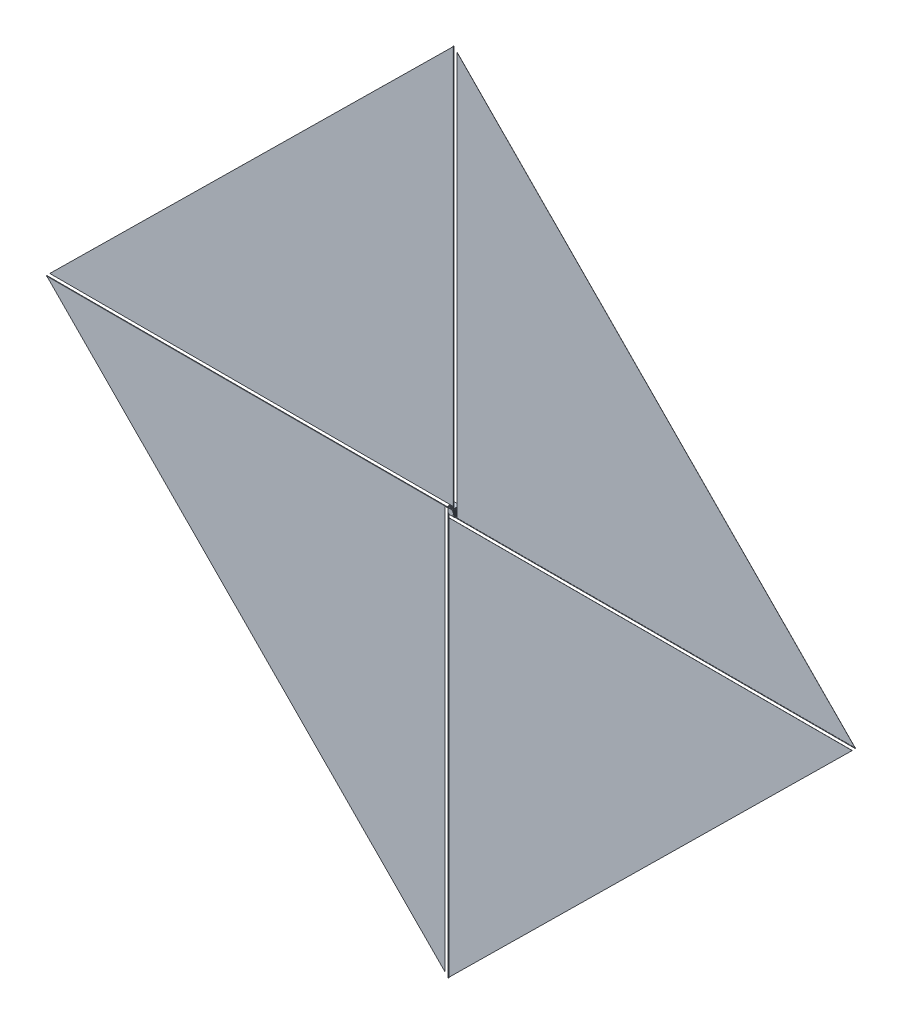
ISO-10303-21;
HEADER;
FILE_DESCRIPTION(('STEP AP214'),'2;1');
FILE_NAME('part.step','',(''),(''),'','','');
FILE_SCHEMA(('AUTOMOTIVE_DESIGN { 1 0 10303 214 1 1 1 1 }'));
ENDSEC;
DATA;
#1=APPLICATION_CONTEXT('core data for automotive mechanical design processes');
#2=APPLICATION_PROTOCOL_DEFINITION('international standard','automotive_design',2000,#1);
#3=PRODUCT_CONTEXT('',#1,'mechanical');
#4=PRODUCT('Part','Part','',(#3));
#5=PRODUCT_RELATED_PRODUCT_CATEGORY('part','',(#4));
#6=PRODUCT_DEFINITION_FORMATION('','',#4);
#7=PRODUCT_DEFINITION_CONTEXT('part definition',#1,'design');
#8=PRODUCT_DEFINITION('design','',#6,#7);
#9=PRODUCT_DEFINITION_SHAPE('','',#8);
#10=(LENGTH_UNIT() NAMED_UNIT(*) SI_UNIT(.MILLI.,.METRE.));
#11=(NAMED_UNIT(*) PLANE_ANGLE_UNIT() SI_UNIT($,.RADIAN.));
#12=(NAMED_UNIT(*) SI_UNIT($,.STERADIAN.) SOLID_ANGLE_UNIT());
#13=UNCERTAINTY_MEASURE_WITH_UNIT(LENGTH_MEASURE(1.E-05),#10,'distance_accuracy_value','');
#14=(GEOMETRIC_REPRESENTATION_CONTEXT(3) GLOBAL_UNCERTAINTY_ASSIGNED_CONTEXT((#13)) GLOBAL_UNIT_ASSIGNED_CONTEXT((#10,
#11,#12)) REPRESENTATION_CONTEXT('',''));
#15=CARTESIAN_POINT('',(0.,0.,0.));
#16=DIRECTION('',(0.,0.,1.));
#17=DIRECTION('',(1.,0.,0.));
#18=AXIS2_PLACEMENT_3D('',#15,#16,#17);
#19=CARTESIAN_POINT('',(84.9999999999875,-7375.,257.755024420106));
#20=DIRECTION('',(-1.,0.,0.));
#21=DIRECTION('',(0.,0.,1.));
#22=AXIS2_PLACEMENT_3D('',#19,#20,#21);
#23=PLANE('',#22);
#24=DIRECTION('',(0.,1.,0.));
#25=VECTOR('',#24,1.);
#26=CARTESIAN_POINT('',(84.9999999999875,-7375.,257.755024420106));
#27=LINE('',#26,#25);
#28=CARTESIAN_POINT('',(84.9999999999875,-7375.,257.755024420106));
#29=VERTEX_POINT('',#28);
#30=CARTESIAN_POINT('',(84.9999999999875,94.9999999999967,257.755024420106));
#31=VERTEX_POINT('',#30);
#32=EDGE_CURVE('E541',#29,#31,#27,.T.);
#33=ORIENTED_EDGE('',*,*,#32,.T.);
#34=DIRECTION('',(0.,0.,-1.));
#35=VECTOR('',#34,1.);
#36=CARTESIAN_POINT('',(84.9999999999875,94.9999999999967,255.255024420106));
#37=LINE('',#36,#35);
#38=CARTESIAN_POINT('',(84.9999999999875,94.9999999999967,265.255024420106));
#39=VERTEX_POINT('',#38);
#40=EDGE_CURVE('E873',#31,#39,#37,.F.);
#41=ORIENTED_EDGE('',*,*,#40,.T.);
#42=DIRECTION('',(0.,1.,0.));
#43=VECTOR('',#42,1.);
#44=CARTESIAN_POINT('',(84.9999999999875,-7375.,265.255024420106));
#45=LINE('',#44,#43);
#46=CARTESIAN_POINT('',(84.9999999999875,-7375.,265.255024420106));
#47=VERTEX_POINT('',#46);
#48=EDGE_CURVE('E537',#47,#39,#45,.T.);
#49=ORIENTED_EDGE('',*,*,#48,.F.);
#50=DIRECTION('',(0.,0.,1.));
#51=VECTOR('',#50,1.);
#52=CARTESIAN_POINT('',(84.9999999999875,-7375.,257.755024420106));
#53=LINE('',#52,#51);
#54=EDGE_CURVE('E527',#29,#47,#53,.T.);
#55=ORIENTED_EDGE('',*,*,#54,.F.);
#56=EDGE_LOOP('',(#33,#41,#49,#55));
#57=FACE_BOUND('',#56,.T.);
#58=DIRECTION('',(0.,-1.,0.));
#59=VECTOR('',#58,1.);
#60=CARTESIAN_POINT('',(84.9999999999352,-7366.26494546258,260.255024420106));
#61=LINE('',#60,#59);
#62=CARTESIAN_POINT('',(84.9999999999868,13.6390843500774,260.255024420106));
#63=VERTEX_POINT('',#62);
#64=CARTESIAN_POINT('',(84.9999999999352,-7366.26494546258,260.255024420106));
#65=VERTEX_POINT('',#64);
#66=EDGE_CURVE('E371',#63,#65,#61,.T.);
#67=ORIENTED_EDGE('',*,*,#66,.T.);
#68=DIRECTION('',(0.,0.,1.));
#69=VECTOR('',#68,1.);
#70=CARTESIAN_POINT('',(84.9999999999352,-7366.26494546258,260.255024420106));
#71=LINE('',#70,#69);
#72=CARTESIAN_POINT('',(84.9999999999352,-7366.26494546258,262.255024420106));
#73=VERTEX_POINT('',#72);
#74=EDGE_CURVE('E356',#65,#73,#71,.T.);
#75=ORIENTED_EDGE('',*,*,#74,.T.);
#76=DIRECTION('',(0.,-1.,0.));
#77=VECTOR('',#76,1.);
#78=CARTESIAN_POINT('',(84.9999999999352,-7366.26494546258,262.255024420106));
#79=LINE('',#78,#77);
#80=CARTESIAN_POINT('',(84.9999999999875,13.6390843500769,262.255024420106));
#81=VERTEX_POINT('',#80);
#82=EDGE_CURVE('E384',#81,#73,#79,.T.);
#83=ORIENTED_EDGE('',*,*,#82,.F.);
#84=DIRECTION('',(0.,0.,1.));
#85=VECTOR('',#84,1.);
#86=CARTESIAN_POINT('',(84.9999999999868,13.6390843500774,260.255024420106));
#87=LINE('',#86,#85);
#88=EDGE_CURVE('E376',#63,#81,#87,.T.);
#89=ORIENTED_EDGE('',*,*,#88,.F.);
#90=EDGE_LOOP('',(#67,#75,#83,#89));
#91=FACE_BOUND('',#90,.T.);
#92=ADVANCED_FACE('F46',(#57,#91),#23,.F.);
#93=CARTESIAN_POINT('',(7624.99999999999,85.0000000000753,257.755024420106));
#94=DIRECTION('',(0.,-1.,0.));
#95=DIRECTION('',(1.,0.,0.));
#96=AXIS2_PLACEMENT_3D('',#93,#94,#95);
#97=PLANE('',#96);
#98=DIRECTION('',(-1.,0.,0.));
#99=VECTOR('',#98,1.);
#100=CARTESIAN_POINT('',(7624.99999999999,85.0000000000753,257.755024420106));
#101=LINE('',#100,#99);
#102=CARTESIAN_POINT('',(7624.99999999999,85.0000000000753,257.755024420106));
#103=VERTEX_POINT('',#102);
#104=CARTESIAN_POINT('',(154.999999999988,84.999999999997,257.755024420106));
#105=VERTEX_POINT('',#104);
#106=EDGE_CURVE('E512',#103,#105,#101,.T.);
#107=ORIENTED_EDGE('',*,*,#106,.T.);
#108=DIRECTION('',(0.,0.,-1.));
#109=VECTOR('',#108,1.);
#110=CARTESIAN_POINT('',(154.999999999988,84.999999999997,255.255024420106));
#111=LINE('',#110,#109);
#112=CARTESIAN_POINT('',(154.999999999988,84.999999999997,265.255024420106));
#113=VERTEX_POINT('',#112);
#114=EDGE_CURVE('E889',#105,#113,#111,.F.);
#115=ORIENTED_EDGE('',*,*,#114,.T.);
#116=DIRECTION('',(-1.,0.,0.));
#117=VECTOR('',#116,1.);
#118=CARTESIAN_POINT('',(7624.99999999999,85.0000000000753,265.255024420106));
#119=LINE('',#118,#117);
#120=CARTESIAN_POINT('',(7624.99999999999,85.0000000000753,265.255024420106));
#121=VERTEX_POINT('',#120);
#122=EDGE_CURVE('E508',#121,#113,#119,.T.);
#123=ORIENTED_EDGE('',*,*,#122,.F.);
#124=DIRECTION('',(0.,0.,1.));
#125=VECTOR('',#124,1.);
#126=CARTESIAN_POINT('',(7624.99999999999,85.0000000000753,257.755024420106));
#127=LINE('',#126,#125);
#128=EDGE_CURVE('E498',#103,#121,#127,.T.);
#129=ORIENTED_EDGE('',*,*,#128,.F.);
#130=EDGE_LOOP('',(#107,#115,#123,#129));
#131=FACE_BOUND('',#130,.T.);
#132=DIRECTION('',(1.,0.,0.));
#133=VECTOR('',#132,1.);
#134=CARTESIAN_POINT('',(7616.26494546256,85.0000000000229,260.255024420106));
#135=LINE('',#134,#133);
#136=CARTESIAN_POINT('',(236.360915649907,84.9999999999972,260.255024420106));
#137=VERTEX_POINT('',#136);
#138=CARTESIAN_POINT('',(7616.26494546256,85.0000000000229,260.255024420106));
#139=VERTEX_POINT('',#138);
#140=EDGE_CURVE('E394',#137,#139,#135,.T.);
#141=ORIENTED_EDGE('',*,*,#140,.T.);
#142=DIRECTION('',(0.,0.,1.));
#143=VECTOR('',#142,1.);
#144=CARTESIAN_POINT('',(7616.26494546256,85.0000000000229,260.255024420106));
#145=LINE('',#144,#143);
#146=CARTESIAN_POINT('',(7616.26494546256,85.0000000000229,262.255024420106));
#147=VERTEX_POINT('',#146);
#148=EDGE_CURVE('E406',#139,#147,#145,.T.);
#149=ORIENTED_EDGE('',*,*,#148,.T.);
#150=DIRECTION('',(1.,0.,0.));
#151=VECTOR('',#150,1.);
#152=CARTESIAN_POINT('',(7616.26494546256,85.0000000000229,262.255024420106));
#153=LINE('',#152,#151);
#154=CARTESIAN_POINT('',(236.360915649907,84.9999999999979,262.255024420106));
#155=VERTEX_POINT('',#154);
#156=EDGE_CURVE('E391',#155,#147,#153,.T.);
#157=ORIENTED_EDGE('',*,*,#156,.F.);
#158=DIRECTION('',(0.,0.,1.));
#159=VECTOR('',#158,1.);
#160=CARTESIAN_POINT('',(236.360915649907,84.9999999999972,260.255024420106));
#161=LINE('',#160,#159);
#162=EDGE_CURVE('E414',#137,#155,#161,.T.);
#163=ORIENTED_EDGE('',*,*,#162,.F.);
#164=EDGE_LOOP('',(#141,#149,#157,#163));
#165=FACE_BOUND('',#164,.T.);
#166=ADVANCED_FACE('F901',(#131,#165),#97,.F.);
#167=CARTESIAN_POINT('',(164.999999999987,7625.,257.755024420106));
#168=DIRECTION('',(1.,0.,0.));
#169=DIRECTION('',(0.,0.,-1.));
#170=AXIS2_PLACEMENT_3D('',#167,#168,#169);
#171=PLANE('',#170);
#172=DIRECTION('',(0.,-1.,0.));
#173=VECTOR('',#172,1.);
#174=CARTESIAN_POINT('',(164.999999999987,7625.,257.755024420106));
#175=LINE('',#174,#173);
#176=CARTESIAN_POINT('',(164.999999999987,7625.,257.755024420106));
#177=VERTEX_POINT('',#176);
#178=CARTESIAN_POINT('',(164.999999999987,154.999999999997,257.755024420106));
#179=VERTEX_POINT('',#178);
#180=EDGE_CURVE('E599',#177,#179,#175,.T.);
#181=ORIENTED_EDGE('',*,*,#180,.T.);
#182=DIRECTION('',(0.,0.,-1.));
#183=VECTOR('',#182,1.);
#184=CARTESIAN_POINT('',(164.999999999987,154.999999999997,255.255024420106));
#185=LINE('',#184,#183);
#186=CARTESIAN_POINT('',(164.999999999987,154.999999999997,265.255024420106));
#187=VERTEX_POINT('',#186);
#188=EDGE_CURVE('E841',#179,#187,#185,.F.);
#189=ORIENTED_EDGE('',*,*,#188,.T.);
#190=DIRECTION('',(0.,-1.,0.));
#191=VECTOR('',#190,1.);
#192=CARTESIAN_POINT('',(164.999999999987,7625.,265.255024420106));
#193=LINE('',#192,#191);
#194=CARTESIAN_POINT('',(164.999999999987,7625.,265.255024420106));
#195=VERTEX_POINT('',#194);
#196=EDGE_CURVE('E595',#195,#187,#193,.T.);
#197=ORIENTED_EDGE('',*,*,#196,.F.);
#198=DIRECTION('',(0.,0.,1.));
#199=VECTOR('',#198,1.);
#200=CARTESIAN_POINT('',(164.999999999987,7625.,257.755024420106));
#201=LINE('',#200,#199);
#202=EDGE_CURVE('E585',#177,#195,#201,.T.);
#203=ORIENTED_EDGE('',*,*,#202,.F.);
#204=EDGE_LOOP('',(#181,#189,#197,#203));
#205=FACE_BOUND('',#204,.T.);
#206=DIRECTION('',(0.,1.,0.));
#207=VECTOR('',#206,1.);
#208=CARTESIAN_POINT('',(164.999999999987,7616.26494546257,260.255024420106));
#209=LINE('',#208,#207);
#210=CARTESIAN_POINT('',(164.999999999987,236.360915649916,260.255024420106));
#211=VERTEX_POINT('',#210);
#212=CARTESIAN_POINT('',(164.999999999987,7616.26494546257,260.255024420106));
#213=VERTEX_POINT('',#212);
#214=EDGE_CURVE('E424',#211,#213,#209,.T.);
#215=ORIENTED_EDGE('',*,*,#214,.T.);
#216=DIRECTION('',(0.,0.,1.));
#217=VECTOR('',#216,1.);
#218=CARTESIAN_POINT('',(164.999999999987,7616.26494546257,260.255024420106));
#219=LINE('',#218,#217);
#220=CARTESIAN_POINT('',(164.999999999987,7616.26494546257,262.255024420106));
#221=VERTEX_POINT('',#220);
#222=EDGE_CURVE('E437',#213,#221,#219,.T.);
#223=ORIENTED_EDGE('',*,*,#222,.T.);
#224=DIRECTION('',(0.,1.,0.));
#225=VECTOR('',#224,1.);
#226=CARTESIAN_POINT('',(164.999999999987,7616.26494546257,262.255024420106));
#227=LINE('',#226,#225);
#228=CARTESIAN_POINT('',(164.999999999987,236.360915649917,262.255024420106));
#229=VERTEX_POINT('',#228);
#230=EDGE_CURVE('E417',#229,#221,#227,.T.);
#231=ORIENTED_EDGE('',*,*,#230,.F.);
#232=DIRECTION('',(0.,0.,1.));
#233=VECTOR('',#232,1.);
#234=CARTESIAN_POINT('',(164.999999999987,236.360915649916,260.255024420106));
#235=LINE('',#234,#233);
#236=EDGE_CURVE('E447',#211,#229,#235,.T.);
#237=ORIENTED_EDGE('',*,*,#236,.F.);
#238=EDGE_LOOP('',(#215,#223,#231,#237));
#239=FACE_BOUND('',#238,.T.);
#240=ADVANCED_FACE('F930',(#205,#239),#171,.F.);
#241=CARTESIAN_POINT('',(-7375.00000000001,164.999999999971,257.755024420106));
#242=DIRECTION('',(0.,1.,0.));
#243=DIRECTION('',(-1.,0.,0.));
#244=AXIS2_PLACEMENT_3D('',#241,#242,#243);
#245=PLANE('',#244);
#246=DIRECTION('',(1.,0.,0.));
#247=VECTOR('',#246,1.);
#248=CARTESIAN_POINT('',(-7375.00000000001,164.999999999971,257.755024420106));
#249=LINE('',#248,#247);
#250=CARTESIAN_POINT('',(-7375.00000000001,164.999999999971,257.755024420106));
#251=VERTEX_POINT('',#250);
#252=CARTESIAN_POINT('',(94.9999999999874,164.999999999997,257.755024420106));
#253=VERTEX_POINT('',#252);
#254=EDGE_CURVE('E570',#251,#253,#249,.T.);
#255=ORIENTED_EDGE('',*,*,#254,.T.);
#256=DIRECTION('',(0.,0.,-1.));
#257=VECTOR('',#256,1.);
#258=CARTESIAN_POINT('',(94.9999999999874,164.999999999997,255.255024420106));
#259=LINE('',#258,#257);
#260=CARTESIAN_POINT('',(94.9999999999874,164.999999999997,265.255024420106));
#261=VERTEX_POINT('',#260);
#262=EDGE_CURVE('E857',#253,#261,#259,.F.);
#263=ORIENTED_EDGE('',*,*,#262,.T.);
#264=DIRECTION('',(1.,0.,0.));
#265=VECTOR('',#264,1.);
#266=CARTESIAN_POINT('',(-7375.00000000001,164.999999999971,265.255024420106));
#267=LINE('',#266,#265);
#268=CARTESIAN_POINT('',(-7375.00000000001,164.999999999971,265.255024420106));
#269=VERTEX_POINT('',#268);
#270=EDGE_CURVE('E566',#269,#261,#267,.T.);
#271=ORIENTED_EDGE('',*,*,#270,.F.);
#272=DIRECTION('',(0.,0.,1.));
#273=VECTOR('',#272,1.);
#274=CARTESIAN_POINT('',(-7375.00000000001,164.999999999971,257.755024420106));
#275=LINE('',#274,#273);
#276=EDGE_CURVE('E556',#251,#269,#275,.T.);
#277=ORIENTED_EDGE('',*,*,#276,.F.);
#278=EDGE_LOOP('',(#255,#263,#271,#277));
#279=FACE_BOUND('',#278,.T.);
#280=DIRECTION('',(-1.,0.,0.));
#281=VECTOR('',#280,1.);
#282=CARTESIAN_POINT('',(-7366.26494546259,164.999999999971,260.255024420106));
#283=LINE('',#282,#281);
#284=CARTESIAN_POINT('',(13.6390843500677,164.999999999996,260.255024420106));
#285=VERTEX_POINT('',#284);
#286=CARTESIAN_POINT('',(-7366.26494546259,164.999999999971,260.255024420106));
#287=VERTEX_POINT('',#286);
#288=EDGE_CURVE('E458',#285,#287,#283,.T.);
#289=ORIENTED_EDGE('',*,*,#288,.T.);
#290=DIRECTION('',(0.,0.,1.));
#291=VECTOR('',#290,1.);
#292=CARTESIAN_POINT('',(-7366.26494546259,164.999999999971,260.255024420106));
#293=LINE('',#292,#291);
#294=CARTESIAN_POINT('',(-7366.26494546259,164.999999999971,262.255024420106));
#295=VERTEX_POINT('',#294);
#296=EDGE_CURVE('E471',#287,#295,#293,.T.);
#297=ORIENTED_EDGE('',*,*,#296,.T.);
#298=DIRECTION('',(-1.,0.,0.));
#299=VECTOR('',#298,1.);
#300=CARTESIAN_POINT('',(-7366.26494546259,164.999999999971,262.255024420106));
#301=LINE('',#300,#299);
#302=CARTESIAN_POINT('',(13.6390843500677,164.999999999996,262.255024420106));
#303=VERTEX_POINT('',#302);
#304=EDGE_CURVE('E451',#303,#295,#301,.T.);
#305=ORIENTED_EDGE('',*,*,#304,.F.);
#306=DIRECTION('',(0.,0.,1.));
#307=VECTOR('',#306,1.);
#308=CARTESIAN_POINT('',(13.6390843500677,164.999999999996,260.255024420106));
#309=LINE('',#308,#307);
#310=EDGE_CURVE('E481',#285,#303,#309,.T.);
#311=ORIENTED_EDGE('',*,*,#310,.F.);
#312=EDGE_LOOP('',(#289,#297,#305,#311));
#313=FACE_BOUND('',#312,.T.);
#314=ADVANCED_FACE('F952',(#279,#313),#245,.F.);
#315=CARTESIAN_POINT('',(124.999999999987,124.999999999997,255.255024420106));
#316=DIRECTION('',(0.,0.,-1.));
#317=DIRECTION('',(-1.,0.,0.));
#318=AXIS2_PLACEMENT_3D('',#315,#316,#317);
#319=CYLINDRICAL_SURFACE('',#318,50.);
#320=DIRECTION('',(0.,0.,-1.));
#321=VECTOR('',#320,1.);
#322=CARTESIAN_POINT('',(77.4999999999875,109.387505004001,255.255024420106));
#323=LINE('',#322,#321);
#324=CARTESIAN_POINT('',(77.4999999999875,109.387505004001,265.255024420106));
#325=VERTEX_POINT('',#324);
#326=CARTESIAN_POINT('',(77.4999999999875,109.387505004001,257.755024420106));
#327=VERTEX_POINT('',#326);
#328=EDGE_CURVE('E881',#325,#327,#323,.T.);
#329=ORIENTED_EDGE('',*,*,#328,.F.);
#330=CARTESIAN_POINT('',(124.999999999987,124.999999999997,265.255024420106));
#331=DIRECTION('',(0.,0.,-1.));
#332=DIRECTION('',(-1.,0.,0.));
#333=AXIS2_PLACEMENT_3D('',#330,#331,#332);
#334=CIRCLE('',#333,50.);
#335=EDGE_CURVE('E869',#39,#325,#334,.T.);
#336=ORIENTED_EDGE('',*,*,#335,.F.);
#337=ORIENTED_EDGE('',*,*,#40,.F.);
#338=CARTESIAN_POINT('',(124.999999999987,124.999999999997,257.755024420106));
#339=DIRECTION('',(0.,0.,1.));
#340=DIRECTION('',(1.,0.,0.));
#341=AXIS2_PLACEMENT_3D('',#338,#339,#340);
#342=CIRCLE('',#341,50.);
#343=EDGE_CURVE('E877',#327,#31,#342,.T.);
#344=ORIENTED_EDGE('',*,*,#343,.F.);
#345=EDGE_LOOP('',(#329,#336,#337,#344));
#346=FACE_BOUND('',#345,.T.);
#347=DIRECTION('',(0.,0.,-1.));
#348=VECTOR('',#347,1.);
#349=CARTESIAN_POINT('',(172.499999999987,140.612494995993,255.255024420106));
#350=LINE('',#349,#348);
#351=CARTESIAN_POINT('',(172.499999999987,140.612494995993,265.255024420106));
#352=VERTEX_POINT('',#351);
#353=CARTESIAN_POINT('',(172.499999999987,140.612494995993,257.755024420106));
#354=VERTEX_POINT('',#353);
#355=EDGE_CURVE('E849',#352,#354,#350,.T.);
#356=ORIENTED_EDGE('',*,*,#355,.F.);
#357=CARTESIAN_POINT('',(124.999999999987,124.999999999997,265.255024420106));
#358=DIRECTION('',(0.,0.,-1.));
#359=DIRECTION('',(-1.,0.,0.));
#360=AXIS2_PLACEMENT_3D('',#357,#358,#359);
#361=CIRCLE('',#360,50.);
#362=EDGE_CURVE('E837',#187,#352,#361,.T.);
#363=ORIENTED_EDGE('',*,*,#362,.F.);
#364=ORIENTED_EDGE('',*,*,#188,.F.);
#365=CARTESIAN_POINT('',(124.999999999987,124.999999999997,257.755024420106));
#366=DIRECTION('',(0.,0.,1.));
#367=DIRECTION('',(1.,0.,0.));
#368=AXIS2_PLACEMENT_3D('',#365,#366,#367);
#369=CIRCLE('',#368,50.);
#370=EDGE_CURVE('E845',#354,#179,#369,.T.);
#371=ORIENTED_EDGE('',*,*,#370,.F.);
#372=EDGE_LOOP('',(#356,#363,#364,#371));
#373=FACE_BOUND('',#372,.T.);
#374=CARTESIAN_POINT('',(124.999999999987,124.999999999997,255.255024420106));
#375=DIRECTION('',(0.,0.,-1.));
#376=DIRECTION('',(-1.,0.,0.));
#377=AXIS2_PLACEMENT_3D('',#374,#375,#376);
#378=CIRCLE('',#377,50.);
#379=CARTESIAN_POINT('',(74.9999999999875,124.999999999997,255.255024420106));
#380=VERTEX_POINT('',#379);
#381=EDGE_CURVE('E607',#380,#380,#378,.T.);
#382=ORIENTED_EDGE('',*,*,#381,.F.);
#383=EDGE_LOOP('',(#382));
#384=FACE_BOUND('',#383,.T.);
#385=CARTESIAN_POINT('',(124.999999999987,124.999999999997,267.755024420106));
#386=DIRECTION('',(0.,0.,-1.));
#387=DIRECTION('',(-1.,0.,0.));
#388=AXIS2_PLACEMENT_3D('',#385,#386,#387);
#389=CIRCLE('',#388,50.);
#390=CARTESIAN_POINT('',(74.9999999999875,124.999999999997,267.755024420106));
#391=VERTEX_POINT('',#390);
#392=EDGE_CURVE('E611',#391,#391,#389,.T.);
#393=ORIENTED_EDGE('',*,*,#392,.T.);
#394=EDGE_LOOP('',(#393));
#395=FACE_BOUND('',#394,.T.);
#396=DIRECTION('',(0.,0.,-1.));
#397=VECTOR('',#396,1.);
#398=CARTESIAN_POINT('',(109.387505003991,172.499999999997,255.255024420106));
#399=LINE('',#398,#397);
#400=CARTESIAN_POINT('',(109.387505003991,172.499999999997,265.255024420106));
#401=VERTEX_POINT('',#400);
#402=CARTESIAN_POINT('',(109.387505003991,172.499999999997,257.755024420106));
#403=VERTEX_POINT('',#402);
#404=EDGE_CURVE('E865',#401,#403,#399,.T.);
#405=ORIENTED_EDGE('',*,*,#404,.F.);
#406=CARTESIAN_POINT('',(124.999999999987,124.999999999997,265.255024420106));
#407=DIRECTION('',(0.,0.,-1.));
#408=DIRECTION('',(0.,1.,0.));
#409=AXIS2_PLACEMENT_3D('',#406,#407,#408);
#410=CIRCLE('',#409,50.);
#411=EDGE_CURVE('E853',#261,#401,#410,.T.);
#412=ORIENTED_EDGE('',*,*,#411,.F.);
#413=ORIENTED_EDGE('',*,*,#262,.F.);
#414=CARTESIAN_POINT('',(124.999999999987,124.999999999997,257.755024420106));
#415=DIRECTION('',(0.,0.,1.));
#416=DIRECTION('',(1.,0.,0.));
#417=AXIS2_PLACEMENT_3D('',#414,#415,#416);
#418=CIRCLE('',#417,50.);
#419=EDGE_CURVE('E861',#403,#253,#418,.T.);
#420=ORIENTED_EDGE('',*,*,#419,.F.);
#421=EDGE_LOOP('',(#405,#412,#413,#420));
#422=FACE_BOUND('',#421,.T.);
#423=DIRECTION('',(0.,0.,-1.));
#424=VECTOR('',#423,1.);
#425=CARTESIAN_POINT('',(140.612494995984,77.4999999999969,255.255024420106));
#426=LINE('',#425,#424);
#427=CARTESIAN_POINT('',(140.612494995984,77.4999999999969,265.255024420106));
#428=VERTEX_POINT('',#427);
#429=CARTESIAN_POINT('',(140.612494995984,77.4999999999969,257.755024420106));
#430=VERTEX_POINT('',#429);
#431=EDGE_CURVE('E11',#428,#430,#426,.T.);
#432=ORIENTED_EDGE('',*,*,#431,.F.);
#433=CARTESIAN_POINT('',(124.999999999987,124.999999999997,265.255024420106));
#434=DIRECTION('',(0.,0.,-1.));
#435=DIRECTION('',(0.,1.,0.));
#436=AXIS2_PLACEMENT_3D('',#433,#434,#435);
#437=CIRCLE('',#436,50.);
#438=EDGE_CURVE('E885',#113,#428,#437,.T.);
#439=ORIENTED_EDGE('',*,*,#438,.F.);
#440=ORIENTED_EDGE('',*,*,#114,.F.);
#441=CARTESIAN_POINT('',(124.999999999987,124.999999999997,257.755024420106));
#442=DIRECTION('',(0.,0.,1.));
#443=DIRECTION('',(1.,0.,0.));
#444=AXIS2_PLACEMENT_3D('',#441,#442,#443);
#445=CIRCLE('',#444,50.);
#446=EDGE_CURVE('E55',#430,#105,#445,.T.);
#447=ORIENTED_EDGE('',*,*,#446,.F.);
#448=EDGE_LOOP('',(#432,#439,#440,#447));
#449=FACE_BOUND('',#448,.T.);
#450=ADVANCED_FACE('F911',(#346,#373,#384,#395,#422,#449),#319,.T.);
#451=CARTESIAN_POINT('',(187.499999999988,62.4999999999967,255.255024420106));
#452=DIRECTION('',(-1.,0.,0.));
#453=DIRECTION('',(0.,0.,1.));
#454=AXIS2_PLACEMENT_3D('',#451,#452,#453);
#455=PLANE('',#454);
#456=DIRECTION('',(0.,1.,0.));
#457=VECTOR('',#456,1.);
#458=CARTESIAN_POINT('',(187.499999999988,62.4999999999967,130.255024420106));
#459=LINE('',#458,#457);
#460=CARTESIAN_POINT('',(187.499999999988,62.4999999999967,130.255024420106));
#461=VERTEX_POINT('',#460);
#462=CARTESIAN_POINT('',(187.499999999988,187.499999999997,130.255024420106));
#463=VERTEX_POINT('',#462);
#464=EDGE_CURVE('E817',#461,#463,#459,.T.);
#465=ORIENTED_EDGE('',*,*,#464,.T.);
#466=DIRECTION('',(0.,0.,-1.));
#467=VECTOR('',#466,1.);
#468=CARTESIAN_POINT('',(187.499999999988,187.499999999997,255.255024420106));
#469=LINE('',#468,#467);
#470=CARTESIAN_POINT('',(187.499999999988,187.499999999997,255.255024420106));
#471=VERTEX_POINT('',#470);
#472=EDGE_CURVE('E825',#471,#463,#469,.T.);
#473=ORIENTED_EDGE('',*,*,#472,.F.);
#474=DIRECTION('',(0.,1.,0.));
#475=VECTOR('',#474,1.);
#476=CARTESIAN_POINT('',(187.499999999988,62.4999999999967,255.255024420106));
#477=LINE('',#476,#475);
#478=CARTESIAN_POINT('',(187.499999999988,62.4999999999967,255.255024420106));
#479=VERTEX_POINT('',#478);
#480=EDGE_CURVE('E804',#479,#471,#477,.T.);
#481=ORIENTED_EDGE('',*,*,#480,.F.);
#482=DIRECTION('',(0.,0.,-1.));
#483=VECTOR('',#482,1.);
#484=CARTESIAN_POINT('',(187.499999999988,62.4999999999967,255.255024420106));
#485=LINE('',#484,#483);
#486=EDGE_CURVE('E829',#479,#461,#485,.T.);
#487=ORIENTED_EDGE('',*,*,#486,.T.);
#488=EDGE_LOOP('',(#465,#473,#481,#487));
#489=FACE_BOUND('',#488,.T.);
#490=DIRECTION('',(0.,0.,1.));
#491=VECTOR('',#490,1.);
#492=CARTESIAN_POINT('',(187.499999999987,174.999999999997,242.755024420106));
#493=LINE('',#492,#491);
#494=CARTESIAN_POINT('',(187.499999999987,174.999999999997,142.755024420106));
#495=VERTEX_POINT('',#494);
#496=CARTESIAN_POINT('',(187.499999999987,174.999999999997,242.755024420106));
#497=VERTEX_POINT('',#496);
#498=EDGE_CURVE('E615',#495,#497,#493,.T.);
#499=ORIENTED_EDGE('',*,*,#498,.F.);
#500=DIRECTION('',(0.,1.,0.));
#501=VECTOR('',#500,1.);
#502=CARTESIAN_POINT('',(187.499999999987,174.999999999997,142.755024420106));
#503=LINE('',#502,#501);
#504=CARTESIAN_POINT('',(187.499999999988,74.9999999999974,142.755024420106));
#505=VERTEX_POINT('',#504);
#506=EDGE_CURVE('E621',#505,#495,#503,.T.);
#507=ORIENTED_EDGE('',*,*,#506,.F.);
#508=DIRECTION('',(0.,0.,-1.));
#509=VECTOR('',#508,1.);
#510=CARTESIAN_POINT('',(187.499999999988,74.9999999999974,242.755024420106));
#511=LINE('',#510,#509);
#512=CARTESIAN_POINT('',(187.499999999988,74.9999999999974,242.755024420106));
#513=VERTEX_POINT('',#512);
#514=EDGE_CURVE('E638',#513,#505,#511,.T.);
#515=ORIENTED_EDGE('',*,*,#514,.F.);
#516=DIRECTION('',(0.,-1.,0.));
#517=VECTOR('',#516,1.);
#518=CARTESIAN_POINT('',(187.499999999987,174.999999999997,242.755024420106));
#519=LINE('',#518,#517);
#520=EDGE_CURVE('E634',#497,#513,#519,.T.);
#521=ORIENTED_EDGE('',*,*,#520,.F.);
#522=EDGE_LOOP('',(#499,#507,#515,#521));
#523=FACE_BOUND('',#522,.T.);
#524=ADVANCED_FACE('F985',(#489,#523),#455,.F.);
#525=CARTESIAN_POINT('',(62.4999999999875,62.4999999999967,255.255024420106));
#526=DIRECTION('',(0.,1.,0.));
#527=DIRECTION('',(0.,0.,1.));
#528=AXIS2_PLACEMENT_3D('',#525,#526,#527);
#529=PLANE('',#528);
#530=DIRECTION('',(1.,0.,0.));
#531=VECTOR('',#530,1.);
#532=CARTESIAN_POINT('',(62.4999999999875,62.4999999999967,130.255024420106));
#533=LINE('',#532,#531);
#534=CARTESIAN_POINT('',(62.4999999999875,62.4999999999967,130.255024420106));
#535=VERTEX_POINT('',#534);
#536=EDGE_CURVE('E814',#535,#461,#533,.T.);
#537=ORIENTED_EDGE('',*,*,#536,.T.);
#538=ORIENTED_EDGE('',*,*,#486,.F.);
#539=DIRECTION('',(1.,0.,0.));
#540=VECTOR('',#539,1.);
#541=CARTESIAN_POINT('',(62.4999999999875,62.4999999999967,255.255024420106));
#542=LINE('',#541,#540);
#543=CARTESIAN_POINT('',(62.4999999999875,62.4999999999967,255.255024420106));
#544=VERTEX_POINT('',#543);
#545=EDGE_CURVE('E800',#544,#479,#542,.T.);
#546=ORIENTED_EDGE('',*,*,#545,.F.);
#547=DIRECTION('',(0.,0.,-1.));
#548=VECTOR('',#547,1.);
#549=CARTESIAN_POINT('',(62.4999999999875,62.4999999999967,255.255024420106));
#550=LINE('',#549,#548);
#551=EDGE_CURVE('E833',#544,#535,#550,.T.);
#552=ORIENTED_EDGE('',*,*,#551,.T.);
#553=EDGE_LOOP('',(#537,#538,#546,#552));
#554=FACE_BOUND('',#553,.T.);
#555=DIRECTION('',(0.,0.,1.));
#556=VECTOR('',#555,1.);
#557=CARTESIAN_POINT('',(174.999999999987,62.4999999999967,242.755024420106));
#558=LINE('',#557,#556);
#559=CARTESIAN_POINT('',(174.999999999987,62.4999999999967,142.755024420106));
#560=VERTEX_POINT('',#559);
#561=CARTESIAN_POINT('',(174.999999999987,62.4999999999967,242.755024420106));
#562=VERTEX_POINT('',#561);
#563=EDGE_CURVE('E660',#560,#562,#558,.T.);
#564=ORIENTED_EDGE('',*,*,#563,.F.);
#565=DIRECTION('',(1.,0.,0.));
#566=VECTOR('',#565,1.);
#567=CARTESIAN_POINT('',(174.999999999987,62.4999999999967,142.755024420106));
#568=LINE('',#567,#566);
#569=CARTESIAN_POINT('',(74.9999999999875,62.4999999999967,142.755024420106));
#570=VERTEX_POINT('',#569);
#571=EDGE_CURVE('E666',#570,#560,#568,.T.);
#572=ORIENTED_EDGE('',*,*,#571,.F.);
#573=DIRECTION('',(0.,0.,-1.));
#574=VECTOR('',#573,1.);
#575=CARTESIAN_POINT('',(74.9999999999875,62.4999999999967,242.755024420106));
#576=LINE('',#575,#574);
#577=CARTESIAN_POINT('',(74.9999999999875,62.4999999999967,242.755024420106));
#578=VERTEX_POINT('',#577);
#579=EDGE_CURVE('E683',#578,#570,#576,.T.);
#580=ORIENTED_EDGE('',*,*,#579,.F.);
#581=DIRECTION('',(-1.,0.,0.));
#582=VECTOR('',#581,1.);
#583=CARTESIAN_POINT('',(174.999999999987,62.4999999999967,242.755024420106));
#584=LINE('',#583,#582);
#585=EDGE_CURVE('E679',#562,#578,#584,.T.);
#586=ORIENTED_EDGE('',*,*,#585,.F.);
#587=EDGE_LOOP('',(#564,#572,#580,#586));
#588=FACE_BOUND('',#587,.T.);
#589=ADVANCED_FACE('F1083',(#554,#588),#529,.F.);
#590=CARTESIAN_POINT('',(62.4999999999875,62.4999999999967,255.255024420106));
#591=DIRECTION('',(1.,0.,0.));
#592=DIRECTION('',(0.,0.,-1.));
#593=AXIS2_PLACEMENT_3D('',#590,#591,#592);
#594=PLANE('',#593);
#595=DIRECTION('',(0.,-1.,0.));
#596=VECTOR('',#595,1.);
#597=CARTESIAN_POINT('',(62.4999999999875,62.4999999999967,130.255024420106));
#598=LINE('',#597,#596);
#599=CARTESIAN_POINT('',(62.4999999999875,187.499999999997,130.255024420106));
#600=VERTEX_POINT('',#599);
#601=EDGE_CURVE('E795',#600,#535,#598,.T.);
#602=ORIENTED_EDGE('',*,*,#601,.T.);
#603=ORIENTED_EDGE('',*,*,#551,.F.);
#604=DIRECTION('',(0.,-1.,0.));
#605=VECTOR('',#604,1.);
#606=CARTESIAN_POINT('',(62.4999999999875,62.4999999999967,255.255024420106));
#607=LINE('',#606,#605);
#608=CARTESIAN_POINT('',(62.4999999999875,187.499999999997,255.255024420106));
#609=VERTEX_POINT('',#608);
#610=EDGE_CURVE('E796',#609,#544,#607,.T.);
#611=ORIENTED_EDGE('',*,*,#610,.F.);
#612=DIRECTION('',(0.,0.,-1.));
#613=VECTOR('',#612,1.);
#614=CARTESIAN_POINT('',(62.4999999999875,187.499999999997,255.255024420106));
#615=LINE('',#614,#613);
#616=EDGE_CURVE('E810',#609,#600,#615,.T.);
#617=ORIENTED_EDGE('',*,*,#616,.T.);
#618=EDGE_LOOP('',(#602,#603,#611,#617));
#619=FACE_BOUND('',#618,.T.);
#620=DIRECTION('',(0.,0.,1.));
#621=VECTOR('',#620,1.);
#622=CARTESIAN_POINT('',(62.4999999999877,74.9999999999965,242.755024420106));
#623=LINE('',#622,#621);
#624=CARTESIAN_POINT('',(62.4999999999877,74.9999999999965,142.755024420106));
#625=VERTEX_POINT('',#624);
#626=CARTESIAN_POINT('',(62.4999999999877,74.9999999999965,242.755024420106));
#627=VERTEX_POINT('',#626);
#628=EDGE_CURVE('E705',#625,#627,#623,.T.);
#629=ORIENTED_EDGE('',*,*,#628,.F.);
#630=DIRECTION('',(0.,-1.,0.));
#631=VECTOR('',#630,1.);
#632=CARTESIAN_POINT('',(62.4999999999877,74.9999999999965,142.755024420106));
#633=LINE('',#632,#631);
#634=CARTESIAN_POINT('',(62.4999999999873,174.999999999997,142.755024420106));
#635=VERTEX_POINT('',#634);
#636=EDGE_CURVE('E711',#635,#625,#633,.T.);
#637=ORIENTED_EDGE('',*,*,#636,.F.);
#638=DIRECTION('',(0.,0.,-1.));
#639=VECTOR('',#638,1.);
#640=CARTESIAN_POINT('',(62.4999999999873,174.999999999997,242.755024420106));
#641=LINE('',#640,#639);
#642=CARTESIAN_POINT('',(62.4999999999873,174.999999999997,242.755024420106));
#643=VERTEX_POINT('',#642);
#644=EDGE_CURVE('E728',#643,#635,#641,.T.);
#645=ORIENTED_EDGE('',*,*,#644,.F.);
#646=DIRECTION('',(0.,1.,0.));
#647=VECTOR('',#646,1.);
#648=CARTESIAN_POINT('',(62.4999999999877,74.9999999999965,242.755024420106));
#649=LINE('',#648,#647);
#650=EDGE_CURVE('E724',#627,#643,#649,.T.);
#651=ORIENTED_EDGE('',*,*,#650,.F.);
#652=EDGE_LOOP('',(#629,#637,#645,#651));
#653=FACE_BOUND('',#652,.T.);
#654=ADVANCED_FACE('F48',(#619,#653),#594,.F.);
#655=CARTESIAN_POINT('',(62.4999999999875,187.499999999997,255.255024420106));
#656=DIRECTION('',(0.,-1.,0.));
#657=DIRECTION('',(0.,0.,-1.));
#658=AXIS2_PLACEMENT_3D('',#655,#656,#657);
#659=PLANE('',#658);
#660=DIRECTION('',(-1.,0.,0.));
#661=VECTOR('',#660,1.);
#662=CARTESIAN_POINT('',(62.4999999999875,187.499999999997,130.255024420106));
#663=LINE('',#662,#661);
#664=EDGE_CURVE('E801',#463,#600,#663,.T.);
#665=ORIENTED_EDGE('',*,*,#664,.T.);
#666=ORIENTED_EDGE('',*,*,#616,.F.);
#667=DIRECTION('',(-1.,0.,0.));
#668=VECTOR('',#667,1.);
#669=CARTESIAN_POINT('',(62.4999999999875,187.499999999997,255.255024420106));
#670=LINE('',#669,#668);
#671=EDGE_CURVE('E807',#471,#609,#670,.T.);
#672=ORIENTED_EDGE('',*,*,#671,.F.);
#673=ORIENTED_EDGE('',*,*,#472,.T.);
#674=EDGE_LOOP('',(#665,#666,#672,#673));
#675=FACE_BOUND('',#674,.T.);
#676=DIRECTION('',(0.,0.,1.));
#677=VECTOR('',#676,1.);
#678=CARTESIAN_POINT('',(74.9999999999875,187.499999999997,242.755024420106));
#679=LINE('',#678,#677);
#680=CARTESIAN_POINT('',(74.9999999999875,187.499999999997,142.755024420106));
#681=VERTEX_POINT('',#680);
#682=CARTESIAN_POINT('',(74.9999999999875,187.499999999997,242.755024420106));
#683=VERTEX_POINT('',#682);
#684=EDGE_CURVE('E750',#681,#683,#679,.T.);
#685=ORIENTED_EDGE('',*,*,#684,.F.);
#686=DIRECTION('',(-1.,0.,0.));
#687=VECTOR('',#686,1.);
#688=CARTESIAN_POINT('',(74.9999999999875,187.499999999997,142.755024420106));
#689=LINE('',#688,#687);
#690=CARTESIAN_POINT('',(174.999999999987,187.499999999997,142.755024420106));
#691=VERTEX_POINT('',#690);
#692=EDGE_CURVE('E756',#691,#681,#689,.T.);
#693=ORIENTED_EDGE('',*,*,#692,.F.);
#694=DIRECTION('',(0.,0.,-1.));
#695=VECTOR('',#694,1.);
#696=CARTESIAN_POINT('',(174.999999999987,187.499999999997,242.755024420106));
#697=LINE('',#696,#695);
#698=CARTESIAN_POINT('',(174.999999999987,187.499999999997,242.755024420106));
#699=VERTEX_POINT('',#698);
#700=EDGE_CURVE('E773',#699,#691,#697,.T.);
#701=ORIENTED_EDGE('',*,*,#700,.F.);
#702=DIRECTION('',(1.,0.,0.));
#703=VECTOR('',#702,1.);
#704=CARTESIAN_POINT('',(74.9999999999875,187.499999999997,242.755024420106));
#705=LINE('',#704,#703);
#706=EDGE_CURVE('E769',#683,#699,#705,.T.);
#707=ORIENTED_EDGE('',*,*,#706,.F.);
#708=EDGE_LOOP('',(#685,#693,#701,#707));
#709=FACE_BOUND('',#708,.T.);
#710=ADVANCED_FACE('F1074',(#675,#709),#659,.F.);
#711=CARTESIAN_POINT('',(62.4999999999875,62.4999999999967,255.255024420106));
#712=DIRECTION('',(0.,0.,-1.));
#713=DIRECTION('',(-1.,0.,0.));
#714=AXIS2_PLACEMENT_3D('',#711,#712,#713);
#715=PLANE('',#714);
#716=ORIENTED_EDGE('',*,*,#381,.T.);
#717=EDGE_LOOP('',(#716));
#718=FACE_BOUND('',#717,.T.);
#719=ORIENTED_EDGE('',*,*,#610,.T.);
#720=ORIENTED_EDGE('',*,*,#545,.T.);
#721=ORIENTED_EDGE('',*,*,#480,.T.);
#722=ORIENTED_EDGE('',*,*,#671,.T.);
#723=EDGE_LOOP('',(#719,#720,#721,#722));
#724=FACE_BOUND('',#723,.T.);
#725=ADVANCED_FACE('F1071',(#718,#724),#715,.F.);
#726=CARTESIAN_POINT('',(62.4999999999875,62.4999999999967,130.255024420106));
#727=DIRECTION('',(0.,0.,-1.));
#728=DIRECTION('',(-1.,0.,0.));
#729=AXIS2_PLACEMENT_3D('',#726,#727,#728);
#730=PLANE('',#729);
#731=ORIENTED_EDGE('',*,*,#601,.F.);
#732=ORIENTED_EDGE('',*,*,#664,.F.);
#733=ORIENTED_EDGE('',*,*,#464,.F.);
#734=ORIENTED_EDGE('',*,*,#536,.F.);
#735=EDGE_LOOP('',(#731,#732,#733,#734));
#736=FACE_BOUND('',#735,.T.);
#737=ADVANCED_FACE('F1069',(#736),#730,.T.);
#738=CARTESIAN_POINT('',(74.9999999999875,199.999999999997,242.755024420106));
#739=DIRECTION('',(1.,0.,0.));
#740=DIRECTION('',(0.,0.,-1.));
#741=AXIS2_PLACEMENT_3D('',#738,#739,#740);
#742=PLANE('',#741);
#743=ORIENTED_EDGE('',*,*,#684,.T.);
#744=DIRECTION('',(0.,-1.,0.));
#745=VECTOR('',#744,1.);
#746=CARTESIAN_POINT('',(74.9999999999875,199.999999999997,242.755024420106));
#747=LINE('',#746,#745);
#748=CARTESIAN_POINT('',(74.9999999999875,199.999999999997,242.755024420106));
#749=VERTEX_POINT('',#748);
#750=EDGE_CURVE('E791',#749,#683,#747,.T.);
#751=ORIENTED_EDGE('',*,*,#750,.F.);
#752=DIRECTION('',(0.,0.,1.));
#753=VECTOR('',#752,1.);
#754=CARTESIAN_POINT('',(74.9999999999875,199.999999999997,242.755024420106));
#755=LINE('',#754,#753);
#756=CARTESIAN_POINT('',(74.9999999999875,199.999999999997,142.755024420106));
#757=VERTEX_POINT('',#756);
#758=EDGE_CURVE('E751',#757,#749,#755,.T.);
#759=ORIENTED_EDGE('',*,*,#758,.F.);
#760=DIRECTION('',(0.,-1.,0.));
#761=VECTOR('',#760,1.);
#762=CARTESIAN_POINT('',(74.9999999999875,199.999999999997,142.755024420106));
#763=LINE('',#762,#761);
#764=EDGE_CURVE('E765',#757,#681,#763,.T.);
#765=ORIENTED_EDGE('',*,*,#764,.T.);
#766=EDGE_LOOP('',(#743,#751,#759,#765));
#767=FACE_BOUND('',#766,.T.);
#768=ADVANCED_FACE('F1065',(#767),#742,.F.);
#769=CARTESIAN_POINT('',(74.9999999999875,199.999999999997,242.755024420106));
#770=DIRECTION('',(0.,0.,-1.));
#771=DIRECTION('',(-1.,0.,0.));
#772=AXIS2_PLACEMENT_3D('',#769,#770,#771);
#773=PLANE('',#772);
#774=ORIENTED_EDGE('',*,*,#706,.T.);
#775=DIRECTION('',(0.,-1.,0.));
#776=VECTOR('',#775,1.);
#777=CARTESIAN_POINT('',(174.999999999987,199.999999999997,242.755024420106));
#778=LINE('',#777,#776);
#779=CARTESIAN_POINT('',(174.999999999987,199.999999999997,242.755024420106));
#780=VERTEX_POINT('',#779);
#781=EDGE_CURVE('E787',#780,#699,#778,.T.);
#782=ORIENTED_EDGE('',*,*,#781,.F.);
#783=DIRECTION('',(1.,0.,0.));
#784=VECTOR('',#783,1.);
#785=CARTESIAN_POINT('',(74.9999999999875,199.999999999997,242.755024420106));
#786=LINE('',#785,#784);
#787=EDGE_CURVE('E755',#749,#780,#786,.T.);
#788=ORIENTED_EDGE('',*,*,#787,.F.);
#789=ORIENTED_EDGE('',*,*,#750,.T.);
#790=EDGE_LOOP('',(#774,#782,#788,#789));
#791=FACE_BOUND('',#790,.T.);
#792=ADVANCED_FACE('F1061',(#791),#773,.F.);
#793=CARTESIAN_POINT('',(174.999999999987,199.999999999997,242.755024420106));
#794=DIRECTION('',(-1.,0.,0.));
#795=DIRECTION('',(0.,0.,1.));
#796=AXIS2_PLACEMENT_3D('',#793,#794,#795);
#797=PLANE('',#796);
#798=ORIENTED_EDGE('',*,*,#700,.T.);
#799=DIRECTION('',(0.,-1.,0.));
#800=VECTOR('',#799,1.);
#801=CARTESIAN_POINT('',(174.999999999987,199.999999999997,142.755024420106));
#802=LINE('',#801,#800);
#803=CARTESIAN_POINT('',(174.999999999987,199.999999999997,142.755024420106));
#804=VERTEX_POINT('',#803);
#805=EDGE_CURVE('E783',#804,#691,#802,.T.);
#806=ORIENTED_EDGE('',*,*,#805,.F.);
#807=DIRECTION('',(0.,0.,-1.));
#808=VECTOR('',#807,1.);
#809=CARTESIAN_POINT('',(174.999999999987,199.999999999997,242.755024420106));
#810=LINE('',#809,#808);
#811=EDGE_CURVE('E759',#780,#804,#810,.T.);
#812=ORIENTED_EDGE('',*,*,#811,.F.);
#813=ORIENTED_EDGE('',*,*,#781,.T.);
#814=EDGE_LOOP('',(#798,#806,#812,#813));
#815=FACE_BOUND('',#814,.T.);
#816=ADVANCED_FACE('F1057',(#815),#797,.F.);
#817=CARTESIAN_POINT('',(74.9999999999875,199.999999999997,142.755024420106));
#818=DIRECTION('',(0.,0.,1.));
#819=DIRECTION('',(1.,0.,0.));
#820=AXIS2_PLACEMENT_3D('',#817,#818,#819);
#821=PLANE('',#820);
#822=ORIENTED_EDGE('',*,*,#692,.T.);
#823=ORIENTED_EDGE('',*,*,#764,.F.);
#824=DIRECTION('',(-1.,0.,0.));
#825=VECTOR('',#824,1.);
#826=CARTESIAN_POINT('',(74.9999999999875,199.999999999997,142.755024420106));
#827=LINE('',#826,#825);
#828=EDGE_CURVE('E762',#804,#757,#827,.T.);
#829=ORIENTED_EDGE('',*,*,#828,.F.);
#830=ORIENTED_EDGE('',*,*,#805,.T.);
#831=EDGE_LOOP('',(#822,#823,#829,#830));
#832=FACE_BOUND('',#831,.T.);
#833=ADVANCED_FACE('F1053',(#832),#821,.F.);
#834=CARTESIAN_POINT('',(62.4999999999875,199.999999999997,130.255024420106));
#835=DIRECTION('',(0.,-1.,0.));
#836=DIRECTION('',(0.,0.,-1.));
#837=AXIS2_PLACEMENT_3D('',#834,#835,#836);
#838=PLANE('',#837);
#839=ORIENTED_EDGE('',*,*,#758,.T.);
#840=ORIENTED_EDGE('',*,*,#787,.T.);
#841=ORIENTED_EDGE('',*,*,#811,.T.);
#842=ORIENTED_EDGE('',*,*,#828,.T.);
#843=EDGE_LOOP('',(#839,#840,#841,#842));
#844=FACE_BOUND('',#843,.T.);
#845=ADVANCED_FACE('F1049',(#844),#838,.F.);
#846=CARTESIAN_POINT('',(49.9999999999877,74.9999999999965,242.755024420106));
#847=DIRECTION('',(0.,1.,0.));
#848=DIRECTION('',(-1.,0.,0.));
#849=AXIS2_PLACEMENT_3D('',#846,#847,#848);
#850=PLANE('',#849);
#851=ORIENTED_EDGE('',*,*,#628,.T.);
#852=DIRECTION('',(1.,0.,0.));
#853=VECTOR('',#852,1.);
#854=CARTESIAN_POINT('',(49.9999999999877,74.9999999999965,242.755024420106));
#855=LINE('',#854,#853);
#856=CARTESIAN_POINT('',(49.9999999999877,74.9999999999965,242.755024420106));
#857=VERTEX_POINT('',#856);
#858=EDGE_CURVE('E746',#857,#627,#855,.T.);
#859=ORIENTED_EDGE('',*,*,#858,.F.);
#860=DIRECTION('',(0.,0.,1.));
#861=VECTOR('',#860,1.);
#862=CARTESIAN_POINT('',(49.9999999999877,74.9999999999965,242.755024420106));
#863=LINE('',#862,#861);
#864=CARTESIAN_POINT('',(49.9999999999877,74.9999999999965,142.755024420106));
#865=VERTEX_POINT('',#864);
#866=EDGE_CURVE('E706',#865,#857,#863,.T.);
#867=ORIENTED_EDGE('',*,*,#866,.F.);
#868=DIRECTION('',(1.,0.,0.));
#869=VECTOR('',#868,1.);
#870=CARTESIAN_POINT('',(49.9999999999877,74.9999999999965,142.755024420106));
#871=LINE('',#870,#869);
#872=EDGE_CURVE('E720',#865,#625,#871,.T.);
#873=ORIENTED_EDGE('',*,*,#872,.T.);
#874=EDGE_LOOP('',(#851,#859,#867,#873));
#875=FACE_BOUND('',#874,.T.);
#876=ADVANCED_FACE('F1045',(#875),#850,.F.);
#877=CARTESIAN_POINT('',(49.9999999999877,74.9999999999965,242.755024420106));
#878=DIRECTION('',(0.,0.,-1.));
#879=DIRECTION('',(-1.,0.,0.));
#880=AXIS2_PLACEMENT_3D('',#877,#878,#879);
#881=PLANE('',#880);
#882=ORIENTED_EDGE('',*,*,#650,.T.);
#883=DIRECTION('',(1.,0.,0.));
#884=VECTOR('',#883,1.);
#885=CARTESIAN_POINT('',(49.9999999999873,174.999999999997,242.755024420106));
#886=LINE('',#885,#884);
#887=CARTESIAN_POINT('',(49.9999999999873,174.999999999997,242.755024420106));
#888=VERTEX_POINT('',#887);
#889=EDGE_CURVE('E742',#888,#643,#886,.T.);
#890=ORIENTED_EDGE('',*,*,#889,.F.);
#891=DIRECTION('',(0.,1.,0.));
#892=VECTOR('',#891,1.);
#893=CARTESIAN_POINT('',(49.9999999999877,74.9999999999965,242.755024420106));
#894=LINE('',#893,#892);
#895=EDGE_CURVE('E710',#857,#888,#894,.T.);
#896=ORIENTED_EDGE('',*,*,#895,.F.);
#897=ORIENTED_EDGE('',*,*,#858,.T.);
#898=EDGE_LOOP('',(#882,#890,#896,#897));
#899=FACE_BOUND('',#898,.T.);
#900=ADVANCED_FACE('F1041',(#899),#881,.F.);
#901=CARTESIAN_POINT('',(49.9999999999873,174.999999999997,242.755024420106));
#902=DIRECTION('',(0.,-1.,0.));
#903=DIRECTION('',(1.,0.,0.));
#904=AXIS2_PLACEMENT_3D('',#901,#902,#903);
#905=PLANE('',#904);
#906=ORIENTED_EDGE('',*,*,#644,.T.);
#907=DIRECTION('',(1.,0.,0.));
#908=VECTOR('',#907,1.);
#909=CARTESIAN_POINT('',(49.9999999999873,174.999999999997,142.755024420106));
#910=LINE('',#909,#908);
#911=CARTESIAN_POINT('',(49.9999999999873,174.999999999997,142.755024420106));
#912=VERTEX_POINT('',#911);
#913=EDGE_CURVE('E738',#912,#635,#910,.T.);
#914=ORIENTED_EDGE('',*,*,#913,.F.);
#915=DIRECTION('',(0.,0.,-1.));
#916=VECTOR('',#915,1.);
#917=CARTESIAN_POINT('',(49.9999999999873,174.999999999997,242.755024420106));
#918=LINE('',#917,#916);
#919=EDGE_CURVE('E714',#888,#912,#918,.T.);
#920=ORIENTED_EDGE('',*,*,#919,.F.);
#921=ORIENTED_EDGE('',*,*,#889,.T.);
#922=EDGE_LOOP('',(#906,#914,#920,#921));
#923=FACE_BOUND('',#922,.T.);
#924=ADVANCED_FACE('F1037',(#923),#905,.F.);
#925=CARTESIAN_POINT('',(49.9999999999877,74.9999999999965,142.755024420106));
#926=DIRECTION('',(0.,0.,1.));
#927=DIRECTION('',(1.,0.,0.));
#928=AXIS2_PLACEMENT_3D('',#925,#926,#927);
#929=PLANE('',#928);
#930=ORIENTED_EDGE('',*,*,#636,.T.);
#931=ORIENTED_EDGE('',*,*,#872,.F.);
#932=DIRECTION('',(0.,-1.,0.));
#933=VECTOR('',#932,1.);
#934=CARTESIAN_POINT('',(49.9999999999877,74.9999999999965,142.755024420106));
#935=LINE('',#934,#933);
#936=EDGE_CURVE('E717',#912,#865,#935,.T.);
#937=ORIENTED_EDGE('',*,*,#936,.F.);
#938=ORIENTED_EDGE('',*,*,#913,.T.);
#939=EDGE_LOOP('',(#930,#931,#937,#938));
#940=FACE_BOUND('',#939,.T.);
#941=ADVANCED_FACE('F1033',(#940),#929,.F.);
#942=CARTESIAN_POINT('',(49.9999999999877,62.4999999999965,130.255024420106));
#943=DIRECTION('',(1.,0.,0.));
#944=DIRECTION('',(0.,0.,-1.));
#945=AXIS2_PLACEMENT_3D('',#942,#943,#944);
#946=PLANE('',#945);
#947=ORIENTED_EDGE('',*,*,#866,.T.);
#948=ORIENTED_EDGE('',*,*,#895,.T.);
#949=ORIENTED_EDGE('',*,*,#919,.T.);
#950=ORIENTED_EDGE('',*,*,#936,.T.);
#951=EDGE_LOOP('',(#947,#948,#949,#950));
#952=FACE_BOUND('',#951,.T.);
#953=ADVANCED_FACE('F1029',(#952),#946,.F.);
#954=CARTESIAN_POINT('',(174.999999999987,49.9999999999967,242.755024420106));
#955=DIRECTION('',(-1.,0.,0.));
#956=DIRECTION('',(0.,0.,1.));
#957=AXIS2_PLACEMENT_3D('',#954,#955,#956);
#958=PLANE('',#957);
#959=ORIENTED_EDGE('',*,*,#563,.T.);
#960=DIRECTION('',(0.,1.,0.));
#961=VECTOR('',#960,1.);
#962=CARTESIAN_POINT('',(174.999999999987,49.9999999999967,242.755024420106));
#963=LINE('',#962,#961);
#964=CARTESIAN_POINT('',(174.999999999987,49.9999999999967,242.755024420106));
#965=VERTEX_POINT('',#964);
#966=EDGE_CURVE('E701',#965,#562,#963,.T.);
#967=ORIENTED_EDGE('',*,*,#966,.F.);
#968=DIRECTION('',(0.,0.,1.));
#969=VECTOR('',#968,1.);
#970=CARTESIAN_POINT('',(174.999999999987,49.9999999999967,242.755024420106));
#971=LINE('',#970,#969);
#972=CARTESIAN_POINT('',(174.999999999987,49.9999999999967,142.755024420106));
#973=VERTEX_POINT('',#972);
#974=EDGE_CURVE('E661',#973,#965,#971,.T.);
#975=ORIENTED_EDGE('',*,*,#974,.F.);
#976=DIRECTION('',(0.,1.,0.));
#977=VECTOR('',#976,1.);
#978=CARTESIAN_POINT('',(174.999999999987,49.9999999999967,142.755024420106));
#979=LINE('',#978,#977);
#980=EDGE_CURVE('E675',#973,#560,#979,.T.);
#981=ORIENTED_EDGE('',*,*,#980,.T.);
#982=EDGE_LOOP('',(#959,#967,#975,#981));
#983=FACE_BOUND('',#982,.T.);
#984=ADVANCED_FACE('F1025',(#983),#958,.F.);
#985=CARTESIAN_POINT('',(174.999999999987,49.9999999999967,242.755024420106));
#986=DIRECTION('',(0.,0.,-1.));
#987=DIRECTION('',(-1.,0.,0.));
#988=AXIS2_PLACEMENT_3D('',#985,#986,#987);
#989=PLANE('',#988);
#990=ORIENTED_EDGE('',*,*,#585,.T.);
#991=DIRECTION('',(0.,1.,0.));
#992=VECTOR('',#991,1.);
#993=CARTESIAN_POINT('',(74.9999999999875,49.9999999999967,242.755024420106));
#994=LINE('',#993,#992);
#995=CARTESIAN_POINT('',(74.9999999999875,49.9999999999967,242.755024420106));
#996=VERTEX_POINT('',#995);
#997=EDGE_CURVE('E697',#996,#578,#994,.T.);
#998=ORIENTED_EDGE('',*,*,#997,.F.);
#999=DIRECTION('',(-1.,0.,0.));
#1000=VECTOR('',#999,1.);
#1001=CARTESIAN_POINT('',(174.999999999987,49.9999999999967,242.755024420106));
#1002=LINE('',#1001,#1000);
#1003=EDGE_CURVE('E665',#965,#996,#1002,.T.);
#1004=ORIENTED_EDGE('',*,*,#1003,.F.);
#1005=ORIENTED_EDGE('',*,*,#966,.T.);
#1006=EDGE_LOOP('',(#990,#998,#1004,#1005));
#1007=FACE_BOUND('',#1006,.T.);
#1008=ADVANCED_FACE('F1021',(#1007),#989,.F.);
#1009=CARTESIAN_POINT('',(74.9999999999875,49.9999999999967,242.755024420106));
#1010=DIRECTION('',(1.,0.,0.));
#1011=DIRECTION('',(0.,0.,-1.));
#1012=AXIS2_PLACEMENT_3D('',#1009,#1010,#1011);
#1013=PLANE('',#1012);
#1014=ORIENTED_EDGE('',*,*,#579,.T.);
#1015=DIRECTION('',(0.,1.,0.));
#1016=VECTOR('',#1015,1.);
#1017=CARTESIAN_POINT('',(74.9999999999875,49.9999999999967,142.755024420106));
#1018=LINE('',#1017,#1016);
#1019=CARTESIAN_POINT('',(74.9999999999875,49.9999999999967,142.755024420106));
#1020=VERTEX_POINT('',#1019);
#1021=EDGE_CURVE('E693',#1020,#570,#1018,.T.);
#1022=ORIENTED_EDGE('',*,*,#1021,.F.);
#1023=DIRECTION('',(0.,0.,-1.));
#1024=VECTOR('',#1023,1.);
#1025=CARTESIAN_POINT('',(74.9999999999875,49.9999999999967,242.755024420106));
#1026=LINE('',#1025,#1024);
#1027=EDGE_CURVE('E669',#996,#1020,#1026,.T.);
#1028=ORIENTED_EDGE('',*,*,#1027,.F.);
#1029=ORIENTED_EDGE('',*,*,#997,.T.);
#1030=EDGE_LOOP('',(#1014,#1022,#1028,#1029));
#1031=FACE_BOUND('',#1030,.T.);
#1032=ADVANCED_FACE('F1017',(#1031),#1013,.F.);
#1033=CARTESIAN_POINT('',(174.999999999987,49.9999999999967,142.755024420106));
#1034=DIRECTION('',(0.,0.,1.));
#1035=DIRECTION('',(1.,0.,0.));
#1036=AXIS2_PLACEMENT_3D('',#1033,#1034,#1035);
#1037=PLANE('',#1036);
#1038=ORIENTED_EDGE('',*,*,#571,.T.);
#1039=ORIENTED_EDGE('',*,*,#980,.F.);
#1040=DIRECTION('',(1.,0.,0.));
#1041=VECTOR('',#1040,1.);
#1042=CARTESIAN_POINT('',(174.999999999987,49.9999999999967,142.755024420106));
#1043=LINE('',#1042,#1041);
#1044=EDGE_CURVE('E672',#1020,#973,#1043,.T.);
#1045=ORIENTED_EDGE('',*,*,#1044,.F.);
#1046=ORIENTED_EDGE('',*,*,#1021,.T.);
#1047=EDGE_LOOP('',(#1038,#1039,#1045,#1046));
#1048=FACE_BOUND('',#1047,.T.);
#1049=ADVANCED_FACE('F1013',(#1048),#1037,.F.);
#1050=CARTESIAN_POINT('',(187.499999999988,49.9999999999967,130.255024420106));
#1051=DIRECTION('',(0.,1.,0.));
#1052=DIRECTION('',(0.,0.,-1.));
#1053=AXIS2_PLACEMENT_3D('',#1050,#1051,#1052);
#1054=PLANE('',#1053);
#1055=ORIENTED_EDGE('',*,*,#974,.T.);
#1056=ORIENTED_EDGE('',*,*,#1003,.T.);
#1057=ORIENTED_EDGE('',*,*,#1027,.T.);
#1058=ORIENTED_EDGE('',*,*,#1044,.T.);
#1059=EDGE_LOOP('',(#1055,#1056,#1057,#1058));
#1060=FACE_BOUND('',#1059,.T.);
#1061=ADVANCED_FACE('F1009',(#1060),#1054,.F.);
#1062=CARTESIAN_POINT('',(199.999999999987,174.999999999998,242.755024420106));
#1063=DIRECTION('',(0.,-1.,0.));
#1064=DIRECTION('',(1.,0.,0.));
#1065=AXIS2_PLACEMENT_3D('',#1062,#1063,#1064);
#1066=PLANE('',#1065);
#1067=ORIENTED_EDGE('',*,*,#498,.T.);
#1068=DIRECTION('',(-1.,0.,0.));
#1069=VECTOR('',#1068,1.);
#1070=CARTESIAN_POINT('',(199.999999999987,174.999999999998,242.755024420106));
#1071=LINE('',#1070,#1069);
#1072=CARTESIAN_POINT('',(199.999999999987,174.999999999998,242.755024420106));
#1073=VERTEX_POINT('',#1072);
#1074=EDGE_CURVE('E656',#1073,#497,#1071,.T.);
#1075=ORIENTED_EDGE('',*,*,#1074,.F.);
#1076=DIRECTION('',(0.,0.,1.));
#1077=VECTOR('',#1076,1.);
#1078=CARTESIAN_POINT('',(199.999999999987,174.999999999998,242.755024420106));
#1079=LINE('',#1078,#1077);
#1080=CARTESIAN_POINT('',(199.999999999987,174.999999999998,142.755024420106));
#1081=VERTEX_POINT('',#1080);
#1082=EDGE_CURVE('E616',#1081,#1073,#1079,.T.);
#1083=ORIENTED_EDGE('',*,*,#1082,.F.);
#1084=DIRECTION('',(-1.,0.,0.));
#1085=VECTOR('',#1084,1.);
#1086=CARTESIAN_POINT('',(199.999999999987,174.999999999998,142.755024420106));
#1087=LINE('',#1086,#1085);
#1088=EDGE_CURVE('E630',#1081,#495,#1087,.T.);
#1089=ORIENTED_EDGE('',*,*,#1088,.T.);
#1090=EDGE_LOOP('',(#1067,#1075,#1083,#1089));
#1091=FACE_BOUND('',#1090,.T.);
#1092=ADVANCED_FACE('F1005',(#1091),#1066,.F.);
#1093=CARTESIAN_POINT('',(199.999999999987,174.999999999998,242.755024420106));
#1094=DIRECTION('',(0.,0.,-1.));
#1095=DIRECTION('',(-1.,0.,0.));
#1096=AXIS2_PLACEMENT_3D('',#1093,#1094,#1095);
#1097=PLANE('',#1096);
#1098=ORIENTED_EDGE('',*,*,#520,.T.);
#1099=DIRECTION('',(-1.,0.,0.));
#1100=VECTOR('',#1099,1.);
#1101=CARTESIAN_POINT('',(199.999999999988,74.9999999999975,242.755024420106));
#1102=LINE('',#1101,#1100);
#1103=CARTESIAN_POINT('',(199.999999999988,74.9999999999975,242.755024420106));
#1104=VERTEX_POINT('',#1103);
#1105=EDGE_CURVE('E652',#1104,#513,#1102,.T.);
#1106=ORIENTED_EDGE('',*,*,#1105,.F.);
#1107=DIRECTION('',(0.,-1.,0.));
#1108=VECTOR('',#1107,1.);
#1109=CARTESIAN_POINT('',(199.999999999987,174.999999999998,242.755024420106));
#1110=LINE('',#1109,#1108);
#1111=EDGE_CURVE('E620',#1073,#1104,#1110,.T.);
#1112=ORIENTED_EDGE('',*,*,#1111,.F.);
#1113=ORIENTED_EDGE('',*,*,#1074,.T.);
#1114=EDGE_LOOP('',(#1098,#1106,#1112,#1113));
#1115=FACE_BOUND('',#1114,.T.);
#1116=ADVANCED_FACE('F1001',(#1115),#1097,.F.);
#1117=CARTESIAN_POINT('',(199.999999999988,74.9999999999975,242.755024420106));
#1118=DIRECTION('',(0.,1.,0.));
#1119=DIRECTION('',(-1.,0.,0.));
#1120=AXIS2_PLACEMENT_3D('',#1117,#1118,#1119);
#1121=PLANE('',#1120);
#1122=ORIENTED_EDGE('',*,*,#514,.T.);
#1123=DIRECTION('',(-1.,0.,0.));
#1124=VECTOR('',#1123,1.);
#1125=CARTESIAN_POINT('',(199.999999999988,74.9999999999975,142.755024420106));
#1126=LINE('',#1125,#1124);
#1127=CARTESIAN_POINT('',(199.999999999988,74.9999999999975,142.755024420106));
#1128=VERTEX_POINT('',#1127);
#1129=EDGE_CURVE('E648',#1128,#505,#1126,.T.);
#1130=ORIENTED_EDGE('',*,*,#1129,.F.);
#1131=DIRECTION('',(0.,0.,-1.));
#1132=VECTOR('',#1131,1.);
#1133=CARTESIAN_POINT('',(199.999999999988,74.9999999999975,242.755024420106));
#1134=LINE('',#1133,#1132);
#1135=EDGE_CURVE('E624',#1104,#1128,#1134,.T.);
#1136=ORIENTED_EDGE('',*,*,#1135,.F.);
#1137=ORIENTED_EDGE('',*,*,#1105,.T.);
#1138=EDGE_LOOP('',(#1122,#1130,#1136,#1137));
#1139=FACE_BOUND('',#1138,.T.);
#1140=ADVANCED_FACE('F997',(#1139),#1121,.F.);
#1141=CARTESIAN_POINT('',(199.999999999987,174.999999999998,142.755024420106));
#1142=DIRECTION('',(0.,0.,1.));
#1143=DIRECTION('',(1.,0.,0.));
#1144=AXIS2_PLACEMENT_3D('',#1141,#1142,#1143);
#1145=PLANE('',#1144);
#1146=ORIENTED_EDGE('',*,*,#506,.T.);
#1147=ORIENTED_EDGE('',*,*,#1088,.F.);
#1148=DIRECTION('',(0.,1.,0.));
#1149=VECTOR('',#1148,1.);
#1150=CARTESIAN_POINT('',(199.999999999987,174.999999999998,142.755024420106));
#1151=LINE('',#1150,#1149);
#1152=EDGE_CURVE('E627',#1128,#1081,#1151,.T.);
#1153=ORIENTED_EDGE('',*,*,#1152,.F.);
#1154=ORIENTED_EDGE('',*,*,#1129,.T.);
#1155=EDGE_LOOP('',(#1146,#1147,#1153,#1154));
#1156=FACE_BOUND('',#1155,.T.);
#1157=ADVANCED_FACE('F993',(#1156),#1145,.F.);
#1158=CARTESIAN_POINT('',(199.999999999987,187.499999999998,130.255024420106));
#1159=DIRECTION('',(-1.,0.,0.));
#1160=DIRECTION('',(0.,0.,-1.));
#1161=AXIS2_PLACEMENT_3D('',#1158,#1159,#1160);
#1162=PLANE('',#1161);
#1163=ORIENTED_EDGE('',*,*,#1082,.T.);
#1164=ORIENTED_EDGE('',*,*,#1111,.T.);
#1165=ORIENTED_EDGE('',*,*,#1135,.T.);
#1166=ORIENTED_EDGE('',*,*,#1152,.T.);
#1167=EDGE_LOOP('',(#1163,#1164,#1165,#1166));
#1168=FACE_BOUND('',#1167,.T.);
#1169=ADVANCED_FACE('F989',(#1168),#1162,.F.);
#1170=CARTESIAN_POINT('',(124.999999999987,124.999999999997,267.755024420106));
#1171=DIRECTION('',(0.,0.,-1.));
#1172=DIRECTION('',(-1.,0.,0.));
#1173=AXIS2_PLACEMENT_3D('',#1170,#1171,#1172);
#1174=PLANE('',#1173);
#1175=ORIENTED_EDGE('',*,*,#392,.F.);
#1176=EDGE_LOOP('',(#1175));
#1177=FACE_BOUND('',#1176,.T.);
#1178=ADVANCED_FACE('F981',(#1177),#1174,.F.);
#1179=CARTESIAN_POINT('',(172.499999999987,7625.,257.755024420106));
#1180=DIRECTION('',(-1.,0.,0.));
#1181=DIRECTION('',(0.,0.,1.));
#1182=AXIS2_PLACEMENT_3D('',#1179,#1180,#1181);
#1183=PLANE('',#1182);
#1184=DIRECTION('',(0.,-1.,0.));
#1185=VECTOR('',#1184,1.);
#1186=CARTESIAN_POINT('',(172.499999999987,7625.,265.255024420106));
#1187=LINE('',#1186,#1185);
#1188=CARTESIAN_POINT('',(172.499999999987,7625.,265.255024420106));
#1189=VERTEX_POINT('',#1188);
#1190=EDGE_CURVE('E591',#1189,#352,#1187,.T.);
#1191=ORIENTED_EDGE('',*,*,#1190,.T.);
#1192=ORIENTED_EDGE('',*,*,#355,.T.);
#1193=DIRECTION('',(0.,-1.,0.));
#1194=VECTOR('',#1193,1.);
#1195=CARTESIAN_POINT('',(172.499999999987,7625.,257.755024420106));
#1196=LINE('',#1195,#1194);
#1197=CARTESIAN_POINT('',(172.499999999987,7625.,257.755024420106));
#1198=VERTEX_POINT('',#1197);
#1199=EDGE_CURVE('E603',#1198,#354,#1196,.T.);
#1200=ORIENTED_EDGE('',*,*,#1199,.F.);
#1201=DIRECTION('',(0.,0.,-1.));
#1202=VECTOR('',#1201,1.);
#1203=CARTESIAN_POINT('',(172.499999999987,7625.,257.755024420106));
#1204=LINE('',#1203,#1202);
#1205=EDGE_CURVE('E578',#1189,#1198,#1204,.T.);
#1206=ORIENTED_EDGE('',*,*,#1205,.F.);
#1207=EDGE_LOOP('',(#1191,#1192,#1200,#1206));
#1208=FACE_BOUND('',#1207,.T.);
#1209=ADVANCED_FACE('F977',(#1208),#1183,.F.);
#1210=CARTESIAN_POINT('',(172.499999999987,7625.,257.755024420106));
#1211=DIRECTION('',(0.,0.,1.));
#1212=DIRECTION('',(1.,0.,0.));
#1213=AXIS2_PLACEMENT_3D('',#1210,#1211,#1212);
#1214=PLANE('',#1213);
#1215=ORIENTED_EDGE('',*,*,#1199,.T.);
#1216=ORIENTED_EDGE('',*,*,#370,.T.);
#1217=ORIENTED_EDGE('',*,*,#180,.F.);
#1218=DIRECTION('',(-1.,0.,0.));
#1219=VECTOR('',#1218,1.);
#1220=CARTESIAN_POINT('',(172.499999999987,7625.,257.755024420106));
#1221=LINE('',#1220,#1219);
#1222=EDGE_CURVE('E582',#1198,#177,#1221,.T.);
#1223=ORIENTED_EDGE('',*,*,#1222,.F.);
#1224=EDGE_LOOP('',(#1215,#1216,#1217,#1223));
#1225=FACE_BOUND('',#1224,.T.);
#1226=ADVANCED_FACE('F970',(#1225),#1214,.F.);
#1227=CARTESIAN_POINT('',(172.499999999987,7625.,265.255024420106));
#1228=DIRECTION('',(0.,0.,-1.));
#1229=DIRECTION('',(-1.,0.,0.));
#1230=AXIS2_PLACEMENT_3D('',#1227,#1228,#1229);
#1231=PLANE('',#1230);
#1232=ORIENTED_EDGE('',*,*,#196,.T.);
#1233=ORIENTED_EDGE('',*,*,#362,.T.);
#1234=ORIENTED_EDGE('',*,*,#1190,.F.);
#1235=DIRECTION('',(1.,0.,0.));
#1236=VECTOR('',#1235,1.);
#1237=CARTESIAN_POINT('',(172.499999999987,7625.,265.255024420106));
#1238=LINE('',#1237,#1236);
#1239=EDGE_CURVE('E588',#195,#1189,#1238,.T.);
#1240=ORIENTED_EDGE('',*,*,#1239,.F.);
#1241=EDGE_LOOP('',(#1232,#1233,#1234,#1240));
#1242=FACE_BOUND('',#1241,.T.);
#1243=ADVANCED_FACE('F966',(#1242),#1231,.F.);
#1244=CARTESIAN_POINT('',(62.4999999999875,7625.,130.255024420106));
#1245=DIRECTION('',(0.,-1.,0.));
#1246=DIRECTION('',(0.,0.,-1.));
#1247=AXIS2_PLACEMENT_3D('',#1244,#1245,#1246);
#1248=PLANE('',#1247);
#1249=ORIENTED_EDGE('',*,*,#1205,.T.);
#1250=ORIENTED_EDGE('',*,*,#1222,.T.);
#1251=ORIENTED_EDGE('',*,*,#202,.T.);
#1252=ORIENTED_EDGE('',*,*,#1239,.T.);
#1253=EDGE_LOOP('',(#1249,#1250,#1251,#1252));
#1254=FACE_BOUND('',#1253,.T.);
#1255=ADVANCED_FACE('F962',(#1254),#1248,.F.);
#1256=CARTESIAN_POINT('',(-7375.00000000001,172.499999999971,257.755024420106));
#1257=DIRECTION('',(0.,-1.,0.));
#1258=DIRECTION('',(1.,0.,0.));
#1259=AXIS2_PLACEMENT_3D('',#1256,#1257,#1258);
#1260=PLANE('',#1259);
#1261=DIRECTION('',(1.,0.,0.));
#1262=VECTOR('',#1261,1.);
#1263=CARTESIAN_POINT('',(-7375.00000000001,172.499999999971,265.255024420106));
#1264=LINE('',#1263,#1262);
#1265=CARTESIAN_POINT('',(-7375.00000000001,172.499999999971,265.255024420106));
#1266=VERTEX_POINT('',#1265);
#1267=EDGE_CURVE('E562',#1266,#401,#1264,.T.);
#1268=ORIENTED_EDGE('',*,*,#1267,.T.);
#1269=ORIENTED_EDGE('',*,*,#404,.T.);
#1270=DIRECTION('',(1.,0.,0.));
#1271=VECTOR('',#1270,1.);
#1272=CARTESIAN_POINT('',(-7375.00000000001,172.499999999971,257.755024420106));
#1273=LINE('',#1272,#1271);
#1274=CARTESIAN_POINT('',(-7375.00000000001,172.499999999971,257.755024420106));
#1275=VERTEX_POINT('',#1274);
#1276=EDGE_CURVE('E574',#1275,#403,#1273,.T.);
#1277=ORIENTED_EDGE('',*,*,#1276,.F.);
#1278=DIRECTION('',(0.,0.,-1.));
#1279=VECTOR('',#1278,1.);
#1280=CARTESIAN_POINT('',(-7375.00000000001,172.499999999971,257.755024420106));
#1281=LINE('',#1280,#1279);
#1282=EDGE_CURVE('E549',#1266,#1275,#1281,.T.);
#1283=ORIENTED_EDGE('',*,*,#1282,.F.);
#1284=EDGE_LOOP('',(#1268,#1269,#1277,#1283));
#1285=FACE_BOUND('',#1284,.T.);
#1286=ADVANCED_FACE('F958',(#1285),#1260,.F.);
#1287=CARTESIAN_POINT('',(-7375.00000000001,172.499999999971,257.755024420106));
#1288=DIRECTION('',(0.,0.,1.));
#1289=DIRECTION('',(1.,0.,0.));
#1290=AXIS2_PLACEMENT_3D('',#1287,#1288,#1289);
#1291=PLANE('',#1290);
#1292=ORIENTED_EDGE('',*,*,#1276,.T.);
#1293=ORIENTED_EDGE('',*,*,#419,.T.);
#1294=ORIENTED_EDGE('',*,*,#254,.F.);
#1295=DIRECTION('',(0.,-1.,0.));
#1296=VECTOR('',#1295,1.);
#1297=CARTESIAN_POINT('',(-7375.00000000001,172.499999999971,257.755024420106));
#1298=LINE('',#1297,#1296);
#1299=EDGE_CURVE('E553',#1275,#251,#1298,.T.);
#1300=ORIENTED_EDGE('',*,*,#1299,.F.);
#1301=EDGE_LOOP('',(#1292,#1293,#1294,#1300));
#1302=FACE_BOUND('',#1301,.T.);
#1303=ADVANCED_FACE('F950',(#1302),#1291,.F.);
#1304=CARTESIAN_POINT('',(-7375.00000000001,172.499999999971,265.255024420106));
#1305=DIRECTION('',(0.,0.,-1.));
#1306=DIRECTION('',(0.,1.,0.));
#1307=AXIS2_PLACEMENT_3D('',#1304,#1305,#1306);
#1308=PLANE('',#1307);
#1309=ORIENTED_EDGE('',*,*,#270,.T.);
#1310=ORIENTED_EDGE('',*,*,#411,.T.);
#1311=ORIENTED_EDGE('',*,*,#1267,.F.);
#1312=DIRECTION('',(0.,1.,0.));
#1313=VECTOR('',#1312,1.);
#1314=CARTESIAN_POINT('',(-7375.00000000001,172.499999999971,265.255024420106));
#1315=LINE('',#1314,#1313);
#1316=EDGE_CURVE('E559',#269,#1266,#1315,.T.);
#1317=ORIENTED_EDGE('',*,*,#1316,.F.);
#1318=EDGE_LOOP('',(#1309,#1310,#1311,#1317));
#1319=FACE_BOUND('',#1318,.T.);
#1320=ADVANCED_FACE('F946',(#1319),#1308,.F.);
#1321=CARTESIAN_POINT('',(-7375.00000000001,62.4999999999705,130.255024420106));
#1322=DIRECTION('',(1.,0.,0.));
#1323=DIRECTION('',(0.,0.,-1.));
#1324=AXIS2_PLACEMENT_3D('',#1321,#1322,#1323);
#1325=PLANE('',#1324);
#1326=ORIENTED_EDGE('',*,*,#1282,.T.);
#1327=ORIENTED_EDGE('',*,*,#1299,.T.);
#1328=ORIENTED_EDGE('',*,*,#276,.T.);
#1329=ORIENTED_EDGE('',*,*,#1316,.T.);
#1330=EDGE_LOOP('',(#1326,#1327,#1328,#1329));
#1331=FACE_BOUND('',#1330,.T.);
#1332=ADVANCED_FACE('F942',(#1331),#1325,.F.);
#1333=CARTESIAN_POINT('',(77.4999999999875,-7375.,257.755024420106));
#1334=DIRECTION('',(1.,0.,0.));
#1335=DIRECTION('',(0.,0.,-1.));
#1336=AXIS2_PLACEMENT_3D('',#1333,#1334,#1335);
#1337=PLANE('',#1336);
#1338=DIRECTION('',(0.,1.,0.));
#1339=VECTOR('',#1338,1.);
#1340=CARTESIAN_POINT('',(77.4999999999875,-7375.,265.255024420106));
#1341=LINE('',#1340,#1339);
#1342=CARTESIAN_POINT('',(77.4999999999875,-7375.,265.255024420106));
#1343=VERTEX_POINT('',#1342);
#1344=EDGE_CURVE('E533',#1343,#325,#1341,.T.);
#1345=ORIENTED_EDGE('',*,*,#1344,.T.);
#1346=ORIENTED_EDGE('',*,*,#328,.T.);
#1347=DIRECTION('',(0.,1.,0.));
#1348=VECTOR('',#1347,1.);
#1349=CARTESIAN_POINT('',(77.4999999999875,-7375.,257.755024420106));
#1350=LINE('',#1349,#1348);
#1351=CARTESIAN_POINT('',(77.4999999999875,-7375.,257.755024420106));
#1352=VERTEX_POINT('',#1351);
#1353=EDGE_CURVE('E545',#1352,#327,#1350,.T.);
#1354=ORIENTED_EDGE('',*,*,#1353,.F.);
#1355=DIRECTION('',(0.,0.,-1.));
#1356=VECTOR('',#1355,1.);
#1357=CARTESIAN_POINT('',(77.4999999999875,-7375.,257.755024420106));
#1358=LINE('',#1357,#1356);
#1359=EDGE_CURVE('E520',#1343,#1352,#1358,.T.);
#1360=ORIENTED_EDGE('',*,*,#1359,.F.);
#1361=EDGE_LOOP('',(#1345,#1346,#1354,#1360));
#1362=FACE_BOUND('',#1361,.T.);
#1363=ADVANCED_FACE('F938',(#1362),#1337,.F.);
#1364=CARTESIAN_POINT('',(77.4999999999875,-7375.,257.755024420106));
#1365=DIRECTION('',(0.,0.,1.));
#1366=DIRECTION('',(1.,0.,0.));
#1367=AXIS2_PLACEMENT_3D('',#1364,#1365,#1366);
#1368=PLANE('',#1367);
#1369=ORIENTED_EDGE('',*,*,#1353,.T.);
#1370=ORIENTED_EDGE('',*,*,#343,.T.);
#1371=ORIENTED_EDGE('',*,*,#32,.F.);
#1372=DIRECTION('',(1.,0.,0.));
#1373=VECTOR('',#1372,1.);
#1374=CARTESIAN_POINT('',(77.4999999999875,-7375.,257.755024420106));
#1375=LINE('',#1374,#1373);
#1376=EDGE_CURVE('E524',#1352,#29,#1375,.T.);
#1377=ORIENTED_EDGE('',*,*,#1376,.F.);
#1378=EDGE_LOOP('',(#1369,#1370,#1371,#1377));
#1379=FACE_BOUND('',#1378,.T.);
#1380=ADVANCED_FACE('F935',(#1379),#1368,.F.);
#1381=CARTESIAN_POINT('',(77.4999999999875,-7375.,265.255024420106));
#1382=DIRECTION('',(0.,0.,-1.));
#1383=DIRECTION('',(-1.,0.,0.));
#1384=AXIS2_PLACEMENT_3D('',#1381,#1382,#1383);
#1385=PLANE('',#1384);
#1386=ORIENTED_EDGE('',*,*,#48,.T.);
#1387=ORIENTED_EDGE('',*,*,#335,.T.);
#1388=ORIENTED_EDGE('',*,*,#1344,.F.);
#1389=DIRECTION('',(-1.,0.,0.));
#1390=VECTOR('',#1389,1.);
#1391=CARTESIAN_POINT('',(77.4999999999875,-7375.,265.255024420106));
#1392=LINE('',#1391,#1390);
#1393=EDGE_CURVE('E530',#47,#1343,#1392,.T.);
#1394=ORIENTED_EDGE('',*,*,#1393,.F.);
#1395=EDGE_LOOP('',(#1386,#1387,#1388,#1394));
#1396=FACE_BOUND('',#1395,.T.);
#1397=ADVANCED_FACE('F933',(#1396),#1385,.F.);
#1398=CARTESIAN_POINT('',(187.499999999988,-7375.,130.255024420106));
#1399=DIRECTION('',(0.,1.,0.));
#1400=DIRECTION('',(0.,0.,-1.));
#1401=AXIS2_PLACEMENT_3D('',#1398,#1399,#1400);
#1402=PLANE('',#1401);
#1403=ORIENTED_EDGE('',*,*,#1359,.T.);
#1404=ORIENTED_EDGE('',*,*,#1376,.T.);
#1405=ORIENTED_EDGE('',*,*,#54,.T.);
#1406=ORIENTED_EDGE('',*,*,#1393,.T.);
#1407=EDGE_LOOP('',(#1403,#1404,#1405,#1406));
#1408=FACE_BOUND('',#1407,.T.);
#1409=ADVANCED_FACE('F1313',(#1408),#1402,.F.);
#1410=CARTESIAN_POINT('',(7624.99999999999,77.5000000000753,257.755024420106));
#1411=DIRECTION('',(0.,1.,0.));
#1412=DIRECTION('',(-1.,0.,0.));
#1413=AXIS2_PLACEMENT_3D('',#1410,#1411,#1412);
#1414=PLANE('',#1413);
#1415=DIRECTION('',(-1.,0.,0.));
#1416=VECTOR('',#1415,1.);
#1417=CARTESIAN_POINT('',(7624.99999999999,77.5000000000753,265.255024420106));
#1418=LINE('',#1417,#1416);
#1419=CARTESIAN_POINT('',(7624.99999999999,77.5000000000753,265.255024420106));
#1420=VERTEX_POINT('',#1419);
#1421=EDGE_CURVE('E504',#1420,#428,#1418,.T.);
#1422=ORIENTED_EDGE('',*,*,#1421,.T.);
#1423=ORIENTED_EDGE('',*,*,#431,.T.);
#1424=DIRECTION('',(-1.,0.,0.));
#1425=VECTOR('',#1424,1.);
#1426=CARTESIAN_POINT('',(7624.99999999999,77.5000000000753,257.755024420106));
#1427=LINE('',#1426,#1425);
#1428=CARTESIAN_POINT('',(7624.99999999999,77.5000000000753,257.755024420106));
#1429=VERTEX_POINT('',#1428);
#1430=EDGE_CURVE('E516',#1429,#430,#1427,.T.);
#1431=ORIENTED_EDGE('',*,*,#1430,.F.);
#1432=DIRECTION('',(0.,0.,-1.));
#1433=VECTOR('',#1432,1.);
#1434=CARTESIAN_POINT('',(7624.99999999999,77.5000000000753,257.755024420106));
#1435=LINE('',#1434,#1433);
#1436=EDGE_CURVE('E485',#1420,#1429,#1435,.T.);
#1437=ORIENTED_EDGE('',*,*,#1436,.F.);
#1438=EDGE_LOOP('',(#1422,#1423,#1431,#1437));
#1439=FACE_BOUND('',#1438,.T.);
#1440=ADVANCED_FACE('F910',(#1439),#1414,.F.);
#1441=CARTESIAN_POINT('',(7624.99999999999,77.5000000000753,257.755024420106));
#1442=DIRECTION('',(0.,0.,1.));
#1443=DIRECTION('',(1.,0.,0.));
#1444=AXIS2_PLACEMENT_3D('',#1441,#1442,#1443);
#1445=PLANE('',#1444);
#1446=ORIENTED_EDGE('',*,*,#1430,.T.);
#1447=ORIENTED_EDGE('',*,*,#446,.T.);
#1448=ORIENTED_EDGE('',*,*,#106,.F.);
#1449=DIRECTION('',(0.,1.,0.));
#1450=VECTOR('',#1449,1.);
#1451=CARTESIAN_POINT('',(7624.99999999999,77.5000000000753,257.755024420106));
#1452=LINE('',#1451,#1450);
#1453=EDGE_CURVE('E495',#1429,#103,#1452,.T.);
#1454=ORIENTED_EDGE('',*,*,#1453,.F.);
#1455=EDGE_LOOP('',(#1446,#1447,#1448,#1454));
#1456=FACE_BOUND('',#1455,.T.);
#1457=ADVANCED_FACE('F896',(#1456),#1445,.F.);
#1458=CARTESIAN_POINT('',(7624.99999999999,77.5000000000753,265.255024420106));
#1459=DIRECTION('',(0.,0.,-1.));
#1460=DIRECTION('',(0.,1.,0.));
#1461=AXIS2_PLACEMENT_3D('',#1458,#1459,#1460);
#1462=PLANE('',#1461);
#1463=ORIENTED_EDGE('',*,*,#122,.T.);
#1464=ORIENTED_EDGE('',*,*,#438,.T.);
#1465=ORIENTED_EDGE('',*,*,#1421,.F.);
#1466=DIRECTION('',(0.,-1.,0.));
#1467=VECTOR('',#1466,1.);
#1468=CARTESIAN_POINT('',(7624.99999999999,77.5000000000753,265.255024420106));
#1469=LINE('',#1468,#1467);
#1470=EDGE_CURVE('E501',#121,#1420,#1469,.T.);
#1471=ORIENTED_EDGE('',*,*,#1470,.F.);
#1472=EDGE_LOOP('',(#1463,#1464,#1465,#1471));
#1473=FACE_BOUND('',#1472,.T.);
#1474=ADVANCED_FACE('F913',(#1473),#1462,.F.);
#1475=CARTESIAN_POINT('',(7624.99999999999,187.500000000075,130.255024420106));
#1476=DIRECTION('',(-1.,0.,0.));
#1477=DIRECTION('',(0.,0.,-1.));
#1478=AXIS2_PLACEMENT_3D('',#1475,#1476,#1477);
#1479=PLANE('',#1478);
#1480=ORIENTED_EDGE('',*,*,#1436,.T.);
#1481=ORIENTED_EDGE('',*,*,#1453,.T.);
#1482=ORIENTED_EDGE('',*,*,#128,.T.);
#1483=ORIENTED_EDGE('',*,*,#1470,.T.);
#1484=EDGE_LOOP('',(#1480,#1481,#1482,#1483));
#1485=FACE_BOUND('',#1484,.T.);
#1486=ADVANCED_FACE('F906',(#1485),#1479,.F.);
#1487=CARTESIAN_POINT('',(13.6390843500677,-7312.47813349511,260.255024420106));
#1488=DIRECTION('',(1.,0.,0.));
#1489=DIRECTION('',(0.,0.,-1.));
#1490=AXIS2_PLACEMENT_3D('',#1487,#1488,#1489);
#1491=PLANE('',#1490);
#1492=DIRECTION('',(0.,1.,0.));
#1493=VECTOR('',#1492,1.);
#1494=CARTESIAN_POINT('',(13.6390843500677,-7312.47813349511,262.255024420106));
#1495=LINE('',#1494,#1493);
#1496=CARTESIAN_POINT('',(13.6390843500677,-7312.47813349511,262.255024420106));
#1497=VERTEX_POINT('',#1496);
#1498=EDGE_CURVE('E463',#1497,#303,#1495,.T.);
#1499=ORIENTED_EDGE('',*,*,#1498,.F.);
#1500=DIRECTION('',(0.,0.,1.));
#1501=VECTOR('',#1500,1.);
#1502=CARTESIAN_POINT('',(13.6390843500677,-7312.47813349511,260.255024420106));
#1503=LINE('',#1502,#1501);
#1504=CARTESIAN_POINT('',(13.6390843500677,-7312.47813349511,260.255024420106));
#1505=VERTEX_POINT('',#1504);
#1506=EDGE_CURVE('E486',#1505,#1497,#1503,.T.);
#1507=ORIENTED_EDGE('',*,*,#1506,.F.);
#1508=DIRECTION('',(0.,1.,0.));
#1509=VECTOR('',#1508,1.);
#1510=CARTESIAN_POINT('',(13.6390843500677,-7312.47813349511,260.255024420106));
#1511=LINE('',#1510,#1509);
#1512=EDGE_CURVE('E467',#1505,#285,#1511,.T.);
#1513=ORIENTED_EDGE('',*,*,#1512,.T.);
#1514=ORIENTED_EDGE('',*,*,#310,.T.);
#1515=EDGE_LOOP('',(#1499,#1507,#1513,#1514));
#1516=FACE_BOUND('',#1515,.T.);
#1517=ADVANCED_FACE('F920',(#1516),#1491,.T.);
#1518=CARTESIAN_POINT('',(-7366.26494546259,164.999999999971,260.255024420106));
#1519=DIRECTION('',(-0.711735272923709,-0.702447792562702,0.));
#1520=DIRECTION('',(0.702447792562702,-0.711735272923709,0.));
#1521=AXIS2_PLACEMENT_3D('',#1518,#1519,#1520);
#1522=PLANE('',#1521);
#1523=DIRECTION('',(0.702447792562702,-0.711735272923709,0.));
#1524=VECTOR('',#1523,1.);
#1525=CARTESIAN_POINT('',(-7366.26494546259,164.999999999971,262.255024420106));
#1526=LINE('',#1525,#1524);
#1527=EDGE_CURVE('E475',#295,#1497,#1526,.T.);
#1528=ORIENTED_EDGE('',*,*,#1527,.F.);
#1529=ORIENTED_EDGE('',*,*,#296,.F.);
#1530=DIRECTION('',(0.702447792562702,-0.711735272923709,0.));
#1531=VECTOR('',#1530,1.);
#1532=CARTESIAN_POINT('',(-7366.26494546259,164.999999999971,260.255024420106));
#1533=LINE('',#1532,#1531);
#1534=EDGE_CURVE('E462',#287,#1505,#1533,.T.);
#1535=ORIENTED_EDGE('',*,*,#1534,.T.);
#1536=ORIENTED_EDGE('',*,*,#1506,.T.);
#1537=EDGE_LOOP('',(#1528,#1529,#1535,#1536));
#1538=FACE_BOUND('',#1537,.T.);
#1539=ADVANCED_FACE('F1358',(#1538),#1522,.T.);
#1540=CARTESIAN_POINT('',(62.4999999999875,62.4999999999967,260.255024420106));
#1541=DIRECTION('',(0.,0.,1.));
#1542=DIRECTION('',(1.,0.,0.));
#1543=AXIS2_PLACEMENT_3D('',#1540,#1541,#1542);
#1544=PLANE('',#1543);
#1545=ORIENTED_EDGE('',*,*,#288,.F.);
#1546=ORIENTED_EDGE('',*,*,#1512,.F.);
#1547=ORIENTED_EDGE('',*,*,#1534,.F.);
#1548=EDGE_LOOP('',(#1545,#1546,#1547));
#1549=FACE_BOUND('',#1548,.T.);
#1550=ADVANCED_FACE('F1368',(#1549),#1544,.F.);
#1551=CARTESIAN_POINT('',(62.4999999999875,62.4999999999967,262.255024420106));
#1552=DIRECTION('',(0.,0.,1.));
#1553=DIRECTION('',(1.,0.,0.));
#1554=AXIS2_PLACEMENT_3D('',#1551,#1552,#1553);
#1555=PLANE('',#1554);
#1556=ORIENTED_EDGE('',*,*,#304,.T.);
#1557=ORIENTED_EDGE('',*,*,#1527,.T.);
#1558=ORIENTED_EDGE('',*,*,#1498,.T.);
#1559=EDGE_LOOP('',(#1556,#1557,#1558));
#1560=FACE_BOUND('',#1559,.T.);
#1561=ADVANCED_FACE('F1378',(#1560),#1555,.T.);
#1562=CARTESIAN_POINT('',(-7312.47813349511,236.360915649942,260.255024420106));
#1563=DIRECTION('',(0.,-1.,0.));
#1564=DIRECTION('',(1.,0.,0.));
#1565=AXIS2_PLACEMENT_3D('',#1562,#1563,#1564);
#1566=PLANE('',#1565);
#1567=DIRECTION('',(1.,0.,0.));
#1568=VECTOR('',#1567,1.);
#1569=CARTESIAN_POINT('',(-7312.47813349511,236.360915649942,262.255024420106));
#1570=LINE('',#1569,#1568);
#1571=CARTESIAN_POINT('',(-7312.47813349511,236.360915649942,262.255024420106));
#1572=VERTEX_POINT('',#1571);
#1573=EDGE_CURVE('E429',#1572,#229,#1570,.T.);
#1574=ORIENTED_EDGE('',*,*,#1573,.F.);
#1575=DIRECTION('',(0.,0.,1.));
#1576=VECTOR('',#1575,1.);
#1577=CARTESIAN_POINT('',(-7312.47813349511,236.360915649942,260.255024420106));
#1578=LINE('',#1577,#1576);
#1579=CARTESIAN_POINT('',(-7312.47813349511,236.360915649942,260.255024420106));
#1580=VERTEX_POINT('',#1579);
#1581=EDGE_CURVE('E452',#1580,#1572,#1578,.T.);
#1582=ORIENTED_EDGE('',*,*,#1581,.F.);
#1583=DIRECTION('',(1.,0.,0.));
#1584=VECTOR('',#1583,1.);
#1585=CARTESIAN_POINT('',(-7312.47813349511,236.360915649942,260.255024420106));
#1586=LINE('',#1585,#1584);
#1587=EDGE_CURVE('E433',#1580,#211,#1586,.T.);
#1588=ORIENTED_EDGE('',*,*,#1587,.T.);
#1589=ORIENTED_EDGE('',*,*,#236,.T.);
#1590=EDGE_LOOP('',(#1574,#1582,#1588,#1589));
#1591=FACE_BOUND('',#1590,.T.);
#1592=ADVANCED_FACE('F1388',(#1591),#1566,.T.);
#1593=CARTESIAN_POINT('',(164.999999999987,7616.26494546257,260.255024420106));
#1594=DIRECTION('',(-0.7024477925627,0.711735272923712,0.));
#1595=DIRECTION('',(-0.711735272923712,-0.7024477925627,0.));
#1596=AXIS2_PLACEMENT_3D('',#1593,#1594,#1595);
#1597=PLANE('',#1596);
#1598=DIRECTION('',(-0.711735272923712,-0.7024477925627,0.));
#1599=VECTOR('',#1598,1.);
#1600=CARTESIAN_POINT('',(164.999999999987,7616.26494546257,262.255024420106));
#1601=LINE('',#1600,#1599);
#1602=EDGE_CURVE('E441',#221,#1572,#1601,.T.);
#1603=ORIENTED_EDGE('',*,*,#1602,.F.);
#1604=ORIENTED_EDGE('',*,*,#222,.F.);
#1605=DIRECTION('',(-0.711735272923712,-0.7024477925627,0.));
#1606=VECTOR('',#1605,1.);
#1607=CARTESIAN_POINT('',(164.999999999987,7616.26494546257,260.255024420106));
#1608=LINE('',#1607,#1606);
#1609=EDGE_CURVE('E428',#213,#1580,#1608,.T.);
#1610=ORIENTED_EDGE('',*,*,#1609,.T.);
#1611=ORIENTED_EDGE('',*,*,#1581,.T.);
#1612=EDGE_LOOP('',(#1603,#1604,#1610,#1611));
#1613=FACE_BOUND('',#1612,.T.);
#1614=ADVANCED_FACE('F1412',(#1613),#1597,.T.);
#1615=CARTESIAN_POINT('',(62.4999999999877,187.499999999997,260.255024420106));
#1616=DIRECTION('',(0.,0.,1.));
#1617=DIRECTION('',(0.,-1.,0.));
#1618=AXIS2_PLACEMENT_3D('',#1615,#1616,#1617);
#1619=PLANE('',#1618);
#1620=ORIENTED_EDGE('',*,*,#214,.F.);
#1621=ORIENTED_EDGE('',*,*,#1587,.F.);
#1622=ORIENTED_EDGE('',*,*,#1609,.F.);
#1623=EDGE_LOOP('',(#1620,#1621,#1622));
#1624=FACE_BOUND('',#1623,.T.);
#1625=ADVANCED_FACE('F1422',(#1624),#1619,.F.);
#1626=CARTESIAN_POINT('',(62.4999999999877,187.499999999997,262.255024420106));
#1627=DIRECTION('',(0.,0.,1.));
#1628=DIRECTION('',(0.,-1.,0.));
#1629=AXIS2_PLACEMENT_3D('',#1626,#1627,#1628);
#1630=PLANE('',#1629);
#1631=ORIENTED_EDGE('',*,*,#230,.T.);
#1632=ORIENTED_EDGE('',*,*,#1602,.T.);
#1633=ORIENTED_EDGE('',*,*,#1573,.T.);
#1634=EDGE_LOOP('',(#1631,#1632,#1633));
#1635=FACE_BOUND('',#1634,.T.);
#1636=ADVANCED_FACE('F1432',(#1635),#1630,.T.);
#1637=CARTESIAN_POINT('',(236.360915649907,7562.4781334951,260.255024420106));
#1638=DIRECTION('',(-1.,0.,0.));
#1639=DIRECTION('',(0.,0.,1.));
#1640=AXIS2_PLACEMENT_3D('',#1637,#1638,#1639);
#1641=PLANE('',#1640);
#1642=DIRECTION('',(0.,-1.,0.));
#1643=VECTOR('',#1642,1.);
#1644=CARTESIAN_POINT('',(236.360915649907,7562.4781334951,262.255024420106));
#1645=LINE('',#1644,#1643);
#1646=CARTESIAN_POINT('',(236.360915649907,7562.4781334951,262.255024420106));
#1647=VERTEX_POINT('',#1646);
#1648=EDGE_CURVE('E70',#1647,#155,#1645,.T.);
#1649=ORIENTED_EDGE('',*,*,#1648,.F.);
#1650=DIRECTION('',(0.,0.,1.));
#1651=VECTOR('',#1650,1.);
#1652=CARTESIAN_POINT('',(236.360915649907,7562.4781334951,260.255024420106));
#1653=LINE('',#1652,#1651);
#1654=CARTESIAN_POINT('',(236.360915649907,7562.4781334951,260.255024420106));
#1655=VERTEX_POINT('',#1654);
#1656=EDGE_CURVE('E418',#1655,#1647,#1653,.T.);
#1657=ORIENTED_EDGE('',*,*,#1656,.F.);
#1658=DIRECTION('',(0.,-1.,0.));
#1659=VECTOR('',#1658,1.);
#1660=CARTESIAN_POINT('',(236.360915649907,7562.4781334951,260.255024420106));
#1661=LINE('',#1660,#1659);
#1662=EDGE_CURVE('E402',#1655,#137,#1661,.T.);
#1663=ORIENTED_EDGE('',*,*,#1662,.T.);
#1664=ORIENTED_EDGE('',*,*,#162,.T.);
#1665=EDGE_LOOP('',(#1649,#1657,#1663,#1664));
#1666=FACE_BOUND('',#1665,.T.);
#1667=ADVANCED_FACE('F1442',(#1666),#1641,.T.);
#1668=CARTESIAN_POINT('',(7616.26494546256,85.0000000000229,260.255024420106));
#1669=DIRECTION('',(0.711735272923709,0.702447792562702,0.));
#1670=DIRECTION('',(-0.702447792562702,0.711735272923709,0.));
#1671=AXIS2_PLACEMENT_3D('',#1668,#1669,#1670);
#1672=PLANE('',#1671);
#1673=DIRECTION('',(-0.702447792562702,0.711735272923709,0.));
#1674=VECTOR('',#1673,1.);
#1675=CARTESIAN_POINT('',(7616.26494546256,85.0000000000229,262.255024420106));
#1676=LINE('',#1675,#1674);
#1677=EDGE_CURVE('E409',#147,#1647,#1676,.T.);
#1678=ORIENTED_EDGE('',*,*,#1677,.F.);
#1679=ORIENTED_EDGE('',*,*,#148,.F.);
#1680=DIRECTION('',(-0.702447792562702,0.711735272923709,0.));
#1681=VECTOR('',#1680,1.);
#1682=CARTESIAN_POINT('',(7616.26494546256,85.0000000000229,260.255024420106));
#1683=LINE('',#1682,#1681);
#1684=EDGE_CURVE('E398',#139,#1655,#1683,.T.);
#1685=ORIENTED_EDGE('',*,*,#1684,.T.);
#1686=ORIENTED_EDGE('',*,*,#1656,.T.);
#1687=EDGE_LOOP('',(#1678,#1679,#1685,#1686));
#1688=FACE_BOUND('',#1687,.T.);
#1689=ADVANCED_FACE('F1452',(#1688),#1672,.T.);
#1690=CARTESIAN_POINT('',(187.499999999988,187.499999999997,260.255024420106));
#1691=DIRECTION('',(0.,0.,1.));
#1692=DIRECTION('',(-1.,0.,0.));
#1693=AXIS2_PLACEMENT_3D('',#1690,#1691,#1692);
#1694=PLANE('',#1693);
#1695=ORIENTED_EDGE('',*,*,#140,.F.);
#1696=ORIENTED_EDGE('',*,*,#1662,.F.);
#1697=ORIENTED_EDGE('',*,*,#1684,.F.);
#1698=EDGE_LOOP('',(#1695,#1696,#1697));
#1699=FACE_BOUND('',#1698,.T.);
#1700=ADVANCED_FACE('F1462',(#1699),#1694,.F.);
#1701=CARTESIAN_POINT('',(187.499999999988,187.499999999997,262.255024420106));
#1702=DIRECTION('',(0.,0.,1.));
#1703=DIRECTION('',(-1.,0.,0.));
#1704=AXIS2_PLACEMENT_3D('',#1701,#1702,#1703);
#1705=PLANE('',#1704);
#1706=ORIENTED_EDGE('',*,*,#156,.T.);
#1707=ORIENTED_EDGE('',*,*,#1677,.T.);
#1708=ORIENTED_EDGE('',*,*,#1648,.T.);
#1709=EDGE_LOOP('',(#1706,#1707,#1708));
#1710=FACE_BOUND('',#1709,.T.);
#1711=ADVANCED_FACE('F1472',(#1710),#1705,.T.);
#1712=CARTESIAN_POINT('',(7562.47813349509,13.639084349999,260.255024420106));
#1713=DIRECTION('',(0.,1.,0.));
#1714=DIRECTION('',(-1.,0.,0.));
#1715=AXIS2_PLACEMENT_3D('',#1712,#1713,#1714);
#1716=PLANE('',#1715);
#1717=DIRECTION('',(-1.,0.,0.));
#1718=VECTOR('',#1717,1.);
#1719=CARTESIAN_POINT('',(7562.47813349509,13.639084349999,262.255024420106));
#1720=LINE('',#1719,#1718);
#1721=CARTESIAN_POINT('',(7562.47813349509,13.639084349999,262.255024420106));
#1722=VERTEX_POINT('',#1721);
#1723=EDGE_CURVE('E62',#1722,#81,#1720,.T.);
#1724=ORIENTED_EDGE('',*,*,#1723,.F.);
#1725=DIRECTION('',(0.,0.,1.));
#1726=VECTOR('',#1725,1.);
#1727=CARTESIAN_POINT('',(7562.47813349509,13.639084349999,260.255024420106));
#1728=LINE('',#1727,#1726);
#1729=CARTESIAN_POINT('',(7562.47813349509,13.639084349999,260.255024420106));
#1730=VERTEX_POINT('',#1729);
#1731=EDGE_CURVE('E366',#1730,#1722,#1728,.T.);
#1732=ORIENTED_EDGE('',*,*,#1731,.F.);
#1733=DIRECTION('',(-1.,0.,0.));
#1734=VECTOR('',#1733,1.);
#1735=CARTESIAN_POINT('',(7562.47813349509,13.639084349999,260.255024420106));
#1736=LINE('',#1735,#1734);
#1737=EDGE_CURVE('E367',#1730,#63,#1736,.T.);
#1738=ORIENTED_EDGE('',*,*,#1737,.T.);
#1739=ORIENTED_EDGE('',*,*,#88,.T.);
#1740=EDGE_LOOP('',(#1724,#1732,#1738,#1739));
#1741=FACE_BOUND('',#1740,.T.);
#1742=ADVANCED_FACE('F1482',(#1741),#1716,.T.);
#1743=CARTESIAN_POINT('',(84.9999999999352,-7366.26494546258,260.255024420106));
#1744=DIRECTION('',(0.702447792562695,-0.711735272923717,0.));
#1745=DIRECTION('',(0.711735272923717,0.702447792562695,0.));
#1746=AXIS2_PLACEMENT_3D('',#1743,#1744,#1745);
#1747=PLANE('',#1746);
#1748=DIRECTION('',(0.711735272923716,0.702447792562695,0.));
#1749=VECTOR('',#1748,1.);
#1750=CARTESIAN_POINT('',(84.9999999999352,-7366.26494546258,262.255024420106));
#1751=LINE('',#1750,#1749);
#1752=EDGE_CURVE('E361',#73,#1722,#1751,.T.);
#1753=ORIENTED_EDGE('',*,*,#1752,.F.);
#1754=ORIENTED_EDGE('',*,*,#74,.F.);
#1755=DIRECTION('',(0.711735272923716,0.702447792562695,0.));
#1756=VECTOR('',#1755,1.);
#1757=CARTESIAN_POINT('',(84.9999999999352,-7366.26494546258,260.255024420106));
#1758=LINE('',#1757,#1756);
#1759=EDGE_CURVE('E359',#65,#1730,#1758,.T.);
#1760=ORIENTED_EDGE('',*,*,#1759,.T.);
#1761=ORIENTED_EDGE('',*,*,#1731,.T.);
#1762=EDGE_LOOP('',(#1753,#1754,#1760,#1761));
#1763=FACE_BOUND('',#1762,.T.);
#1764=ADVANCED_FACE('F358',(#1763),#1747,.T.);
#1765=CARTESIAN_POINT('',(187.499999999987,62.4999999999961,260.255024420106));
#1766=DIRECTION('',(0.,0.,1.));
#1767=DIRECTION('',(0.,1.,0.));
#1768=AXIS2_PLACEMENT_3D('',#1765,#1766,#1767);
#1769=PLANE('',#1768);
#1770=ORIENTED_EDGE('',*,*,#66,.F.);
#1771=ORIENTED_EDGE('',*,*,#1737,.F.);
#1772=ORIENTED_EDGE('',*,*,#1759,.F.);
#1773=EDGE_LOOP('',(#1770,#1771,#1772));
#1774=FACE_BOUND('',#1773,.T.);
#1775=ADVANCED_FACE('F370',(#1774),#1769,.F.);
#1776=CARTESIAN_POINT('',(187.499999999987,62.4999999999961,262.255024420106));
#1777=DIRECTION('',(0.,0.,1.));
#1778=DIRECTION('',(0.,1.,0.));
#1779=AXIS2_PLACEMENT_3D('',#1776,#1777,#1778);
#1780=PLANE('',#1779);
#1781=ORIENTED_EDGE('',*,*,#82,.T.);
#1782=ORIENTED_EDGE('',*,*,#1752,.T.);
#1783=ORIENTED_EDGE('',*,*,#1723,.T.);
#1784=EDGE_LOOP('',(#1781,#1782,#1783));
#1785=FACE_BOUND('',#1784,.T.);
#1786=ADVANCED_FACE('F1508',(#1785),#1780,.T.);
#1787=CLOSED_SHELL('',(#92,#166,#240,#314,#450,#524,#589,#654,#710,#725,#737,#768,#792,#816,
#833,#845,#876,#900,#924,#941,#953,#984,#1008,#1032,#1049,#1061,#1092,#1116,#1140,#1157,#1169,
#1178,#1209,#1226,#1243,#1255,#1286,#1303,#1320,#1332,#1363,#1380,#1397,#1409,#1440,#1457,#1474,
#1486,#1517,#1539,#1550,#1561,#1592,#1614,#1625,#1636,#1667,#1689,#1700,#1711,#1742,#1764,#1775,#1786));
#1788=MANIFOLD_SOLID_BREP('B2',#1787);
#1789=ADVANCED_BREP_SHAPE_REPRESENTATION('',(#18,#1788),#14);
#1790=SHAPE_DEFINITION_REPRESENTATION(#9,#1789);
ENDSEC;
END-ISO-10303-21;
